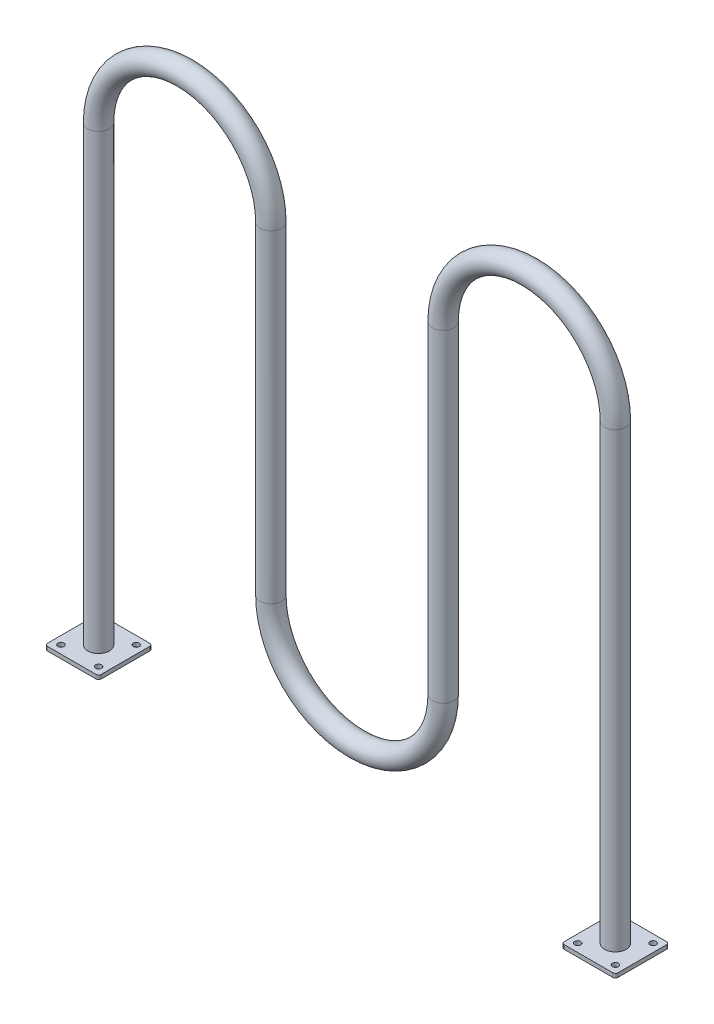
ISO-10303-21;
HEADER;
FILE_DESCRIPTION(('STEP AP214'),'2;1');
FILE_NAME('part.step','',(''),(''),'','','');
FILE_SCHEMA(('AUTOMOTIVE_DESIGN { 1 0 10303 214 1 1 1 1 }'));
ENDSEC;
DATA;
#1=APPLICATION_CONTEXT('core data for automotive mechanical design processes');
#2=APPLICATION_PROTOCOL_DEFINITION('international standard','automotive_design',2000,#1);
#3=PRODUCT_CONTEXT('',#1,'mechanical');
#4=PRODUCT('Part','Part','',(#3));
#5=PRODUCT_RELATED_PRODUCT_CATEGORY('part','',(#4));
#6=PRODUCT_DEFINITION_FORMATION('','',#4);
#7=PRODUCT_DEFINITION_CONTEXT('part definition',#1,'design');
#8=PRODUCT_DEFINITION('design','',#6,#7);
#9=PRODUCT_DEFINITION_SHAPE('','',#8);
#10=(LENGTH_UNIT() NAMED_UNIT(*) SI_UNIT(.MILLI.,.METRE.));
#11=(NAMED_UNIT(*) PLANE_ANGLE_UNIT() SI_UNIT($,.RADIAN.));
#12=(NAMED_UNIT(*) SI_UNIT($,.STERADIAN.) SOLID_ANGLE_UNIT());
#13=UNCERTAINTY_MEASURE_WITH_UNIT(LENGTH_MEASURE(1.E-05),#10,'distance_accuracy_value','');
#14=(GEOMETRIC_REPRESENTATION_CONTEXT(3) GLOBAL_UNCERTAINTY_ASSIGNED_CONTEXT((#13)) GLOBAL_UNIT_ASSIGNED_CONTEXT((#10,
#11,#12)) REPRESENTATION_CONTEXT('',''));
#15=CARTESIAN_POINT('',(0.,0.,0.));
#16=DIRECTION('',(0.,0.,1.));
#17=DIRECTION('',(1.,0.,0.));
#18=AXIS2_PLACEMENT_3D('',#15,#16,#17);
#19=CARTESIAN_POINT('',(609.6,-304.8,0.));
#20=DIRECTION('',(0.,1.,0.));
#21=DIRECTION('',(-1.,0.,0.));
#22=AXIS2_PLACEMENT_3D('',#19,#20,#21);
#23=CYLINDRICAL_SURFACE('',#22,25.4);
#24=CARTESIAN_POINT('',(609.6,762.,0.));
#25=DIRECTION('',(0.,-1.,0.));
#26=DIRECTION('',(1.,0.,0.));
#27=AXIS2_PLACEMENT_3D('',#24,#25,#26);
#28=CIRCLE('',#27,25.4);
#29=CARTESIAN_POINT('',(635.,762.,0.));
#30=VERTEX_POINT('',#29);
#31=EDGE_CURVE('E240',#30,#30,#28,.T.);
#32=ORIENTED_EDGE('',*,*,#31,.T.);
#33=EDGE_LOOP('',(#32));
#34=FACE_BOUND('',#33,.T.);
#35=CARTESIAN_POINT('',(609.6,-304.8,0.));
#36=DIRECTION('',(0.,-1.,0.));
#37=DIRECTION('',(1.,0.,0.));
#38=AXIS2_PLACEMENT_3D('',#35,#36,#37);
#39=CIRCLE('',#38,25.4);
#40=CARTESIAN_POINT('',(635.,-304.8,0.));
#41=VERTEX_POINT('',#40);
#42=EDGE_CURVE('E237',#41,#41,#39,.T.);
#43=ORIENTED_EDGE('',*,*,#42,.F.);
#44=EDGE_LOOP('',(#43));
#45=FACE_BOUND('',#44,.T.);
#46=ADVANCED_FACE('F62',(#34,#45),#23,.T.);
#47=CARTESIAN_POINT('',(406.4,762.,0.));
#48=DIRECTION('',(0.,0.,1.));
#49=DIRECTION('',(1.,0.,0.));
#50=AXIS2_PLACEMENT_3D('',#47,#48,#49);
#51=TOROIDAL_SURFACE('',#50,203.2,25.4);
#52=CARTESIAN_POINT('',(203.2,762.,0.));
#53=DIRECTION('',(0.,1.,0.));
#54=DIRECTION('',(-1.,0.,0.));
#55=AXIS2_PLACEMENT_3D('',#52,#53,#54);
#56=CIRCLE('',#55,25.4);
#57=CARTESIAN_POINT('',(177.8,762.,0.));
#58=VERTEX_POINT('',#57);
#59=EDGE_CURVE('E243',#58,#58,#56,.T.);
#60=CARTESIAN_POINT('',(406.4,762.,0.));
#61=DIRECTION('',(0.,0.,1.));
#62=DIRECTION('',(1.,0.,0.));
#63=AXIS2_PLACEMENT_3D('',#60,#61,#62);
#64=CIRCLE('',#63,228.6);
#65=EDGE_CURVE('',#30,#58,#64,.T.);
#66=ORIENTED_EDGE('',*,*,#31,.F.);
#67=ORIENTED_EDGE('',*,*,#59,.T.);
#68=ORIENTED_EDGE('',*,*,#65,.T.);
#69=ORIENTED_EDGE('',*,*,#65,.F.);
#70=EDGE_LOOP('',(#66,#68,#67,#69));
#71=FACE_BOUND('',#70,.T.);
#72=ADVANCED_FACE('F839',(#71),#51,.T.);
#73=CARTESIAN_POINT('',(203.2,762.,0.));
#74=DIRECTION('',(0.,-1.,0.));
#75=DIRECTION('',(0.,0.,-1.));
#76=AXIS2_PLACEMENT_3D('',#73,#74,#75);
#77=CYLINDRICAL_SURFACE('',#76,25.4);
#78=CARTESIAN_POINT('',(203.2,0.,0.));
#79=DIRECTION('',(0.,1.,0.));
#80=DIRECTION('',(-1.,0.,0.));
#81=AXIS2_PLACEMENT_3D('',#78,#79,#80);
#82=CIRCLE('',#81,25.4);
#83=CARTESIAN_POINT('',(228.6,0.,0.));
#84=VERTEX_POINT('',#83);
#85=EDGE_CURVE('E246',#84,#84,#82,.T.);
#86=ORIENTED_EDGE('',*,*,#85,.T.);
#87=EDGE_LOOP('',(#86));
#88=FACE_BOUND('',#87,.T.);
#89=ORIENTED_EDGE('',*,*,#59,.F.);
#90=EDGE_LOOP('',(#89));
#91=FACE_BOUND('',#90,.T.);
#92=ADVANCED_FACE('F830',(#88,#91),#77,.T.);
#93=CARTESIAN_POINT('',(0.,0.,0.));
#94=DIRECTION('',(0.,0.,-1.));
#95=DIRECTION('',(-1.,0.,0.));
#96=AXIS2_PLACEMENT_3D('',#93,#94,#95);
#97=TOROIDAL_SURFACE('',#96,203.2,25.4);
#98=CARTESIAN_POINT('',(-203.2,0.,0.));
#99=DIRECTION('',(0.,-1.,0.));
#100=DIRECTION('',(1.,0.,0.));
#101=AXIS2_PLACEMENT_3D('',#98,#99,#100);
#102=CIRCLE('',#101,25.4);
#103=CARTESIAN_POINT('',(-228.6,0.,0.));
#104=VERTEX_POINT('',#103);
#105=EDGE_CURVE('E249',#104,#104,#102,.T.);
#106=CARTESIAN_POINT('',(0.,0.,0.));
#107=DIRECTION('',(0.,0.,-1.));
#108=DIRECTION('',(-1.,0.,0.));
#109=AXIS2_PLACEMENT_3D('',#106,#107,#108);
#110=CIRCLE('',#109,228.6);
#111=EDGE_CURVE('',#84,#104,#110,.T.);
#112=ORIENTED_EDGE('',*,*,#85,.F.);
#113=ORIENTED_EDGE('',*,*,#105,.T.);
#114=ORIENTED_EDGE('',*,*,#111,.T.);
#115=ORIENTED_EDGE('',*,*,#111,.F.);
#116=EDGE_LOOP('',(#112,#114,#113,#115));
#117=FACE_BOUND('',#116,.T.);
#118=ADVANCED_FACE('F822',(#117),#97,.T.);
#119=CARTESIAN_POINT('',(-203.2,0.,0.));
#120=DIRECTION('',(0.,1.,0.));
#121=DIRECTION('',(0.,0.,1.));
#122=AXIS2_PLACEMENT_3D('',#119,#120,#121);
#123=CYLINDRICAL_SURFACE('',#122,25.4);
#124=CARTESIAN_POINT('',(-203.2,762.,0.));
#125=DIRECTION('',(0.,-1.,0.));
#126=DIRECTION('',(1.,0.,0.));
#127=AXIS2_PLACEMENT_3D('',#124,#125,#126);
#128=CIRCLE('',#127,25.4);
#129=CARTESIAN_POINT('',(-177.8,762.,0.));
#130=VERTEX_POINT('',#129);
#131=EDGE_CURVE('E252',#130,#130,#128,.T.);
#132=ORIENTED_EDGE('',*,*,#131,.T.);
#133=EDGE_LOOP('',(#132));
#134=FACE_BOUND('',#133,.T.);
#135=ORIENTED_EDGE('',*,*,#105,.F.);
#136=EDGE_LOOP('',(#135));
#137=FACE_BOUND('',#136,.T.);
#138=ADVANCED_FACE('F407',(#134,#137),#123,.T.);
#139=CARTESIAN_POINT('',(-406.4,762.,0.));
#140=DIRECTION('',(0.,0.,1.));
#141=DIRECTION('',(1.,0.,0.));
#142=AXIS2_PLACEMENT_3D('',#139,#140,#141);
#143=TOROIDAL_SURFACE('',#142,203.2,25.4);
#144=CARTESIAN_POINT('',(-609.6,762.,0.));
#145=DIRECTION('',(0.,1.,0.));
#146=DIRECTION('',(-1.,0.,0.));
#147=AXIS2_PLACEMENT_3D('',#144,#145,#146);
#148=CIRCLE('',#147,25.4);
#149=CARTESIAN_POINT('',(-635.,762.,0.));
#150=VERTEX_POINT('',#149);
#151=EDGE_CURVE('E255',#150,#150,#148,.T.);
#152=CARTESIAN_POINT('',(-406.4,762.,0.));
#153=DIRECTION('',(0.,0.,1.));
#154=DIRECTION('',(1.,0.,0.));
#155=AXIS2_PLACEMENT_3D('',#152,#153,#154);
#156=CIRCLE('',#155,228.6);
#157=EDGE_CURVE('',#130,#150,#156,.T.);
#158=ORIENTED_EDGE('',*,*,#131,.F.);
#159=ORIENTED_EDGE('',*,*,#151,.T.);
#160=ORIENTED_EDGE('',*,*,#157,.T.);
#161=ORIENTED_EDGE('',*,*,#157,.F.);
#162=EDGE_LOOP('',(#158,#160,#159,#161));
#163=FACE_BOUND('',#162,.T.);
#164=ADVANCED_FACE('F399',(#163),#143,.T.);
#165=CARTESIAN_POINT('',(-609.6,762.,0.));
#166=DIRECTION('',(0.,-1.,0.));
#167=DIRECTION('',(1.,0.,0.));
#168=AXIS2_PLACEMENT_3D('',#165,#166,#167);
#169=CYLINDRICAL_SURFACE('',#168,25.4);
#170=CARTESIAN_POINT('',(-609.6,-304.8,0.));
#171=DIRECTION('',(0.,1.,0.));
#172=DIRECTION('',(-1.,0.,0.));
#173=AXIS2_PLACEMENT_3D('',#170,#171,#172);
#174=CIRCLE('',#173,25.4);
#175=CARTESIAN_POINT('',(-635.,-304.8,0.));
#176=VERTEX_POINT('',#175);
#177=EDGE_CURVE('E213',#176,#176,#174,.T.);
#178=ORIENTED_EDGE('',*,*,#177,.T.);
#179=EDGE_LOOP('',(#178));
#180=FACE_BOUND('',#179,.T.);
#181=ORIENTED_EDGE('',*,*,#151,.F.);
#182=EDGE_LOOP('',(#181));
#183=FACE_BOUND('',#182,.T.);
#184=ADVANCED_FACE('F397',(#180,#183),#169,.T.);
#185=CARTESIAN_POINT('',(1.36357091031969E-13,-314.325,0.));
#186=DIRECTION('',(0.,1.,0.));
#187=DIRECTION('',(-1.,0.,0.));
#188=AXIS2_PLACEMENT_3D('',#185,#186,#187);
#189=PLANE('',#188);
#190=DIRECTION('',(0.,0.,-1.));
#191=VECTOR('',#190,1.);
#192=CARTESIAN_POINT('',(-673.099999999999,-314.325,-63.5));
#193=LINE('',#192,#191);
#194=CARTESIAN_POINT('',(-673.099999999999,-314.325,57.1500000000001));
#195=VERTEX_POINT('',#194);
#196=CARTESIAN_POINT('',(-673.099999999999,-314.325,-57.15));
#197=VERTEX_POINT('',#196);
#198=EDGE_CURVE('E365',#195,#197,#193,.T.);
#199=ORIENTED_EDGE('',*,*,#198,.T.);
#200=CARTESIAN_POINT('',(-666.75,-314.325,-57.15));
#201=DIRECTION('',(0.,1.,0.));
#202=DIRECTION('',(-1.,0.,0.));
#203=AXIS2_PLACEMENT_3D('',#200,#201,#202);
#204=CIRCLE('',#203,6.35);
#205=CARTESIAN_POINT('',(-666.75,-314.325,-63.5));
#206=VERTEX_POINT('',#205);
#207=EDGE_CURVE('E272',#197,#206,#204,.F.);
#208=ORIENTED_EDGE('',*,*,#207,.T.);
#209=DIRECTION('',(1.,0.,0.));
#210=VECTOR('',#209,1.);
#211=CARTESIAN_POINT('',(-673.099999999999,-314.325,-63.5));
#212=LINE('',#211,#210);
#213=CARTESIAN_POINT('',(-552.449999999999,-314.325,-63.5));
#214=VERTEX_POINT('',#213);
#215=EDGE_CURVE('E196',#206,#214,#212,.T.);
#216=ORIENTED_EDGE('',*,*,#215,.T.);
#217=CARTESIAN_POINT('',(-552.449999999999,-314.325,-57.15));
#218=DIRECTION('',(0.,1.,0.));
#219=DIRECTION('',(-1.,0.,0.));
#220=AXIS2_PLACEMENT_3D('',#217,#218,#219);
#221=CIRCLE('',#220,6.35);
#222=CARTESIAN_POINT('',(-546.099999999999,-314.325,-57.15));
#223=VERTEX_POINT('',#222);
#224=EDGE_CURVE('E270',#214,#223,#221,.F.);
#225=ORIENTED_EDGE('',*,*,#224,.T.);
#226=DIRECTION('',(0.,0.,1.));
#227=VECTOR('',#226,1.);
#228=CARTESIAN_POINT('',(-546.099999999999,-314.325,-63.5));
#229=LINE('',#228,#227);
#230=CARTESIAN_POINT('',(-546.099999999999,-314.325,57.1500000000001));
#231=VERTEX_POINT('',#230);
#232=EDGE_CURVE('E203',#223,#231,#229,.T.);
#233=ORIENTED_EDGE('',*,*,#232,.T.);
#234=CARTESIAN_POINT('',(-552.449999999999,-314.325,57.1500000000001));
#235=DIRECTION('',(0.,1.,0.));
#236=DIRECTION('',(-1.,0.,0.));
#237=AXIS2_PLACEMENT_3D('',#234,#235,#236);
#238=CIRCLE('',#237,6.35);
#239=CARTESIAN_POINT('',(-552.449999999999,-314.325,63.5000000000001));
#240=VERTEX_POINT('',#239);
#241=EDGE_CURVE('E268',#231,#240,#238,.F.);
#242=ORIENTED_EDGE('',*,*,#241,.T.);
#243=DIRECTION('',(-1.,0.,0.));
#244=VECTOR('',#243,1.);
#245=CARTESIAN_POINT('',(-673.099999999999,-314.325,63.5000000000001));
#246=LINE('',#245,#244);
#247=CARTESIAN_POINT('',(-666.75,-314.325,63.5000000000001));
#248=VERTEX_POINT('',#247);
#249=EDGE_CURVE('E207',#240,#248,#246,.T.);
#250=ORIENTED_EDGE('',*,*,#249,.T.);
#251=CARTESIAN_POINT('',(-666.75,-314.325,57.1500000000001));
#252=DIRECTION('',(0.,1.,0.));
#253=DIRECTION('',(-1.,0.,0.));
#254=AXIS2_PLACEMENT_3D('',#251,#252,#253);
#255=CIRCLE('',#254,6.35);
#256=EDGE_CURVE('E266',#248,#195,#255,.F.);
#257=ORIENTED_EDGE('',*,*,#256,.T.);
#258=EDGE_LOOP('',(#199,#208,#216,#225,#233,#242,#250,#257));
#259=FACE_BOUND('',#258,.T.);
#260=CARTESIAN_POINT('',(-654.05,-314.325,44.45));
#261=DIRECTION('',(0.,-1.,0.));
#262=DIRECTION('',(1.,0.,0.));
#263=AXIS2_PLACEMENT_3D('',#260,#261,#262);
#264=CIRCLE('',#263,7.14374999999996);
#265=CARTESIAN_POINT('',(-661.19375,-314.325,44.45));
#266=VERTEX_POINT('',#265);
#267=EDGE_CURVE('E357',#266,#266,#264,.T.);
#268=ORIENTED_EDGE('',*,*,#267,.F.);
#269=EDGE_LOOP('',(#268));
#270=FACE_BOUND('',#269,.T.);
#271=CARTESIAN_POINT('',(-565.15,-314.325,44.45));
#272=DIRECTION('',(0.,-1.,0.));
#273=DIRECTION('',(1.,0.,0.));
#274=AXIS2_PLACEMENT_3D('',#271,#272,#273);
#275=CIRCLE('',#274,7.14374999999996);
#276=CARTESIAN_POINT('',(-572.29375,-314.325,44.45));
#277=VERTEX_POINT('',#276);
#278=EDGE_CURVE('E351',#277,#277,#275,.T.);
#279=ORIENTED_EDGE('',*,*,#278,.F.);
#280=EDGE_LOOP('',(#279));
#281=FACE_BOUND('',#280,.T.);
#282=CARTESIAN_POINT('',(-565.15,-314.325,-44.4499999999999));
#283=DIRECTION('',(0.,-1.,0.));
#284=DIRECTION('',(1.,0.,0.));
#285=AXIS2_PLACEMENT_3D('',#282,#283,#284);
#286=CIRCLE('',#285,7.14374999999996);
#287=CARTESIAN_POINT('',(-572.29375,-314.325,-44.4499999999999));
#288=VERTEX_POINT('',#287);
#289=EDGE_CURVE('E345',#288,#288,#286,.T.);
#290=ORIENTED_EDGE('',*,*,#289,.F.);
#291=EDGE_LOOP('',(#290));
#292=FACE_BOUND('',#291,.T.);
#293=CARTESIAN_POINT('',(-654.05,-314.325,-44.4499999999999));
#294=DIRECTION('',(0.,-1.,0.));
#295=DIRECTION('',(1.,0.,0.));
#296=AXIS2_PLACEMENT_3D('',#293,#294,#295);
#297=CIRCLE('',#296,7.14374999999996);
#298=CARTESIAN_POINT('',(-661.19375,-314.325,-44.4499999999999));
#299=VERTEX_POINT('',#298);
#300=EDGE_CURVE('E339',#299,#299,#297,.T.);
#301=ORIENTED_EDGE('',*,*,#300,.F.);
#302=EDGE_LOOP('',(#301));
#303=FACE_BOUND('',#302,.T.);
#304=ADVANCED_FACE('F383',(#259,#270,#281,#292,#303),#189,.F.);
#305=CARTESIAN_POINT('',(1.33226762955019E-13,-304.8,0.));
#306=DIRECTION('',(0.,1.,0.));
#307=DIRECTION('',(-1.,0.,0.));
#308=AXIS2_PLACEMENT_3D('',#305,#306,#307);
#309=PLANE('',#308);
#310=ORIENTED_EDGE('',*,*,#177,.F.);
#311=EDGE_LOOP('',(#310));
#312=FACE_BOUND('',#311,.T.);
#313=CARTESIAN_POINT('',(-565.15,-304.8,-44.4499999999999));
#314=DIRECTION('',(0.,-1.,0.));
#315=DIRECTION('',(1.,0.,0.));
#316=AXIS2_PLACEMENT_3D('',#313,#314,#315);
#317=CIRCLE('',#316,7.14374999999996);
#318=CARTESIAN_POINT('',(-572.29375,-304.8,-44.4499999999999));
#319=VERTEX_POINT('',#318);
#320=EDGE_CURVE('E342',#319,#319,#317,.T.);
#321=ORIENTED_EDGE('',*,*,#320,.T.);
#322=EDGE_LOOP('',(#321));
#323=FACE_BOUND('',#322,.T.);
#324=CARTESIAN_POINT('',(-654.05,-304.8,44.45));
#325=DIRECTION('',(0.,-1.,0.));
#326=DIRECTION('',(1.,0.,0.));
#327=AXIS2_PLACEMENT_3D('',#324,#325,#326);
#328=CIRCLE('',#327,7.14374999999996);
#329=CARTESIAN_POINT('',(-661.19375,-304.8,44.45));
#330=VERTEX_POINT('',#329);
#331=EDGE_CURVE('E354',#330,#330,#328,.T.);
#332=ORIENTED_EDGE('',*,*,#331,.T.);
#333=EDGE_LOOP('',(#332));
#334=FACE_BOUND('',#333,.T.);
#335=DIRECTION('',(1.,0.,0.));
#336=VECTOR('',#335,1.);
#337=CARTESIAN_POINT('',(-673.099999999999,-304.8,-63.5));
#338=LINE('',#337,#336);
#339=CARTESIAN_POINT('',(-666.75,-304.8,-63.5));
#340=VERTEX_POINT('',#339);
#341=CARTESIAN_POINT('',(-552.449999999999,-304.8,-63.5));
#342=VERTEX_POINT('',#341);
#343=EDGE_CURVE('E193',#340,#342,#338,.T.);
#344=ORIENTED_EDGE('',*,*,#343,.F.);
#345=CARTESIAN_POINT('',(-666.75,-304.8,-57.15));
#346=DIRECTION('',(0.,1.,0.));
#347=DIRECTION('',(-1.,0.,0.));
#348=AXIS2_PLACEMENT_3D('',#345,#346,#347);
#349=CIRCLE('',#348,6.35);
#350=CARTESIAN_POINT('',(-673.099999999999,-304.8,-57.15));
#351=VERTEX_POINT('',#350);
#352=EDGE_CURVE('E176',#340,#351,#349,.T.);
#353=ORIENTED_EDGE('',*,*,#352,.T.);
#354=DIRECTION('',(0.,0.,-1.));
#355=VECTOR('',#354,1.);
#356=CARTESIAN_POINT('',(-673.099999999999,-304.8,-63.5));
#357=LINE('',#356,#355);
#358=CARTESIAN_POINT('',(-673.099999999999,-304.8,57.1500000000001));
#359=VERTEX_POINT('',#358);
#360=EDGE_CURVE('E204',#359,#351,#357,.T.);
#361=ORIENTED_EDGE('',*,*,#360,.F.);
#362=CARTESIAN_POINT('',(-666.75,-304.8,57.1500000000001));
#363=DIRECTION('',(0.,1.,0.));
#364=DIRECTION('',(-1.,0.,0.));
#365=AXIS2_PLACEMENT_3D('',#362,#363,#364);
#366=CIRCLE('',#365,6.35);
#367=CARTESIAN_POINT('',(-666.75,-304.8,63.5000000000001));
#368=VERTEX_POINT('',#367);
#369=EDGE_CURVE('E197',#359,#368,#366,.T.);
#370=ORIENTED_EDGE('',*,*,#369,.T.);
#371=DIRECTION('',(-1.,0.,0.));
#372=VECTOR('',#371,1.);
#373=CARTESIAN_POINT('',(-673.099999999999,-304.8,63.5000000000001));
#374=LINE('',#373,#372);
#375=CARTESIAN_POINT('',(-552.449999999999,-304.8,63.5000000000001));
#376=VERTEX_POINT('',#375);
#377=EDGE_CURVE('E209',#376,#368,#374,.T.);
#378=ORIENTED_EDGE('',*,*,#377,.F.);
#379=CARTESIAN_POINT('',(-552.449999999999,-304.8,57.1500000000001));
#380=DIRECTION('',(0.,1.,0.));
#381=DIRECTION('',(-1.,0.,0.));
#382=AXIS2_PLACEMENT_3D('',#379,#380,#381);
#383=CIRCLE('',#382,6.35);
#384=CARTESIAN_POINT('',(-546.099999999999,-304.8,57.1500000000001));
#385=VERTEX_POINT('',#384);
#386=EDGE_CURVE('E260',#376,#385,#383,.T.);
#387=ORIENTED_EDGE('',*,*,#386,.T.);
#388=DIRECTION('',(0.,0.,1.));
#389=VECTOR('',#388,1.);
#390=CARTESIAN_POINT('',(-546.099999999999,-304.8,-63.5));
#391=LINE('',#390,#389);
#392=CARTESIAN_POINT('',(-546.099999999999,-304.8,-57.15));
#393=VERTEX_POINT('',#392);
#394=EDGE_CURVE('E360',#393,#385,#391,.T.);
#395=ORIENTED_EDGE('',*,*,#394,.F.);
#396=CARTESIAN_POINT('',(-552.449999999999,-304.8,-57.15));
#397=DIRECTION('',(0.,1.,0.));
#398=DIRECTION('',(-1.,0.,0.));
#399=AXIS2_PLACEMENT_3D('',#396,#397,#398);
#400=CIRCLE('',#399,6.35);
#401=EDGE_CURVE('E187',#393,#342,#400,.T.);
#402=ORIENTED_EDGE('',*,*,#401,.T.);
#403=EDGE_LOOP('',(#344,#353,#361,#370,#378,#387,#395,#402));
#404=FACE_BOUND('',#403,.T.);
#405=CARTESIAN_POINT('',(-565.15,-304.8,44.45));
#406=DIRECTION('',(0.,-1.,0.));
#407=DIRECTION('',(1.,0.,0.));
#408=AXIS2_PLACEMENT_3D('',#405,#406,#407);
#409=CIRCLE('',#408,7.14374999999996);
#410=CARTESIAN_POINT('',(-572.29375,-304.8,44.45));
#411=VERTEX_POINT('',#410);
#412=EDGE_CURVE('E348',#411,#411,#409,.T.);
#413=ORIENTED_EDGE('',*,*,#412,.T.);
#414=EDGE_LOOP('',(#413));
#415=FACE_BOUND('',#414,.T.);
#416=CARTESIAN_POINT('',(-654.05,-304.8,-44.4499999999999));
#417=DIRECTION('',(0.,-1.,0.));
#418=DIRECTION('',(1.,0.,0.));
#419=AXIS2_PLACEMENT_3D('',#416,#417,#418);
#420=CIRCLE('',#419,7.14374999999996);
#421=CARTESIAN_POINT('',(-661.19375,-304.8,-44.4499999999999));
#422=VERTEX_POINT('',#421);
#423=EDGE_CURVE('E338',#422,#422,#420,.T.);
#424=ORIENTED_EDGE('',*,*,#423,.T.);
#425=EDGE_LOOP('',(#424));
#426=FACE_BOUND('',#425,.T.);
#427=ADVANCED_FACE('F200',(#312,#323,#334,#404,#415,#426),#309,.T.);
#428=CARTESIAN_POINT('',(-546.099999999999,-314.325,-63.5));
#429=DIRECTION('',(-1.,0.,0.));
#430=DIRECTION('',(0.,-1.,0.));
#431=AXIS2_PLACEMENT_3D('',#428,#429,#430);
#432=PLANE('',#431);
#433=ORIENTED_EDGE('',*,*,#232,.F.);
#434=DIRECTION('',(0.,1.,0.));
#435=VECTOR('',#434,1.);
#436=CARTESIAN_POINT('',(-546.099999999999,-314.325,-57.15));
#437=LINE('',#436,#435);
#438=EDGE_CURVE('E276',#223,#393,#437,.T.);
#439=ORIENTED_EDGE('',*,*,#438,.T.);
#440=ORIENTED_EDGE('',*,*,#394,.T.);
#441=DIRECTION('',(0.,1.,0.));
#442=VECTOR('',#441,1.);
#443=CARTESIAN_POINT('',(-546.099999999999,-314.325,57.1500000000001));
#444=LINE('',#443,#442);
#445=EDGE_CURVE('E274',#385,#231,#444,.F.);
#446=ORIENTED_EDGE('',*,*,#445,.T.);
#447=EDGE_LOOP('',(#433,#439,#440,#446));
#448=FACE_BOUND('',#447,.T.);
#449=ADVANCED_FACE('F395',(#448),#432,.F.);
#450=CARTESIAN_POINT('',(-673.099999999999,-314.325,63.5000000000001));
#451=DIRECTION('',(0.,0.,-1.));
#452=DIRECTION('',(-1.,0.,0.));
#453=AXIS2_PLACEMENT_3D('',#450,#451,#452);
#454=PLANE('',#453);
#455=ORIENTED_EDGE('',*,*,#249,.F.);
#456=DIRECTION('',(0.,1.,0.));
#457=VECTOR('',#456,1.);
#458=CARTESIAN_POINT('',(-552.449999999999,-314.325,63.5000000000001));
#459=LINE('',#458,#457);
#460=EDGE_CURVE('E281',#240,#376,#459,.T.);
#461=ORIENTED_EDGE('',*,*,#460,.T.);
#462=ORIENTED_EDGE('',*,*,#377,.T.);
#463=DIRECTION('',(0.,1.,0.));
#464=VECTOR('',#463,1.);
#465=CARTESIAN_POINT('',(-666.75,-314.325,63.5000000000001));
#466=LINE('',#465,#464);
#467=EDGE_CURVE('E279',#368,#248,#466,.F.);
#468=ORIENTED_EDGE('',*,*,#467,.T.);
#469=EDGE_LOOP('',(#455,#461,#462,#468));
#470=FACE_BOUND('',#469,.T.);
#471=ADVANCED_FACE('F375',(#470),#454,.F.);
#472=CARTESIAN_POINT('',(-673.099999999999,-314.325,-63.5));
#473=DIRECTION('',(1.,0.,0.));
#474=DIRECTION('',(0.,1.,0.));
#475=AXIS2_PLACEMENT_3D('',#472,#473,#474);
#476=PLANE('',#475);
#477=ORIENTED_EDGE('',*,*,#360,.T.);
#478=DIRECTION('',(0.,1.,0.));
#479=VECTOR('',#478,1.);
#480=CARTESIAN_POINT('',(-673.099999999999,-314.325,-57.15));
#481=LINE('',#480,#479);
#482=EDGE_CURVE('E181',#351,#197,#481,.F.);
#483=ORIENTED_EDGE('',*,*,#482,.T.);
#484=ORIENTED_EDGE('',*,*,#198,.F.);
#485=DIRECTION('',(0.,1.,0.));
#486=VECTOR('',#485,1.);
#487=CARTESIAN_POINT('',(-673.099999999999,-314.325,57.1500000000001));
#488=LINE('',#487,#486);
#489=EDGE_CURVE('E186',#195,#359,#488,.T.);
#490=ORIENTED_EDGE('',*,*,#489,.T.);
#491=EDGE_LOOP('',(#477,#483,#484,#490));
#492=FACE_BOUND('',#491,.T.);
#493=ADVANCED_FACE('F386',(#492),#476,.F.);
#494=CARTESIAN_POINT('',(-673.099999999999,-314.325,-63.5));
#495=DIRECTION('',(0.,0.,1.));
#496=DIRECTION('',(1.,0.,0.));
#497=AXIS2_PLACEMENT_3D('',#494,#495,#496);
#498=PLANE('',#497);
#499=ORIENTED_EDGE('',*,*,#215,.F.);
#500=DIRECTION('',(0.,1.,0.));
#501=VECTOR('',#500,1.);
#502=CARTESIAN_POINT('',(-666.75,-314.325,-63.5));
#503=LINE('',#502,#501);
#504=EDGE_CURVE('E180',#206,#340,#503,.T.);
#505=ORIENTED_EDGE('',*,*,#504,.T.);
#506=ORIENTED_EDGE('',*,*,#343,.T.);
#507=DIRECTION('',(0.,1.,0.));
#508=VECTOR('',#507,1.);
#509=CARTESIAN_POINT('',(-552.449999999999,-314.325,-63.5));
#510=LINE('',#509,#508);
#511=EDGE_CURVE('E198',#342,#214,#510,.F.);
#512=ORIENTED_EDGE('',*,*,#511,.T.);
#513=EDGE_LOOP('',(#499,#505,#506,#512));
#514=FACE_BOUND('',#513,.T.);
#515=ADVANCED_FACE('F192',(#514),#498,.F.);
#516=CARTESIAN_POINT('',(-654.05,-314.325,44.45));
#517=DIRECTION('',(0.,1.,0.));
#518=DIRECTION('',(-1.,0.,0.));
#519=AXIS2_PLACEMENT_3D('',#516,#517,#518);
#520=CYLINDRICAL_SURFACE('',#519,7.14374999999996);
#521=CARTESIAN_POINT('',(-661.19375,-314.325,44.45));
#522=CARTESIAN_POINT('',(-661.19375,-314.22578125,44.45));
#523=CARTESIAN_POINT('',(-661.19375,-314.1265625,44.45));
#524=CARTESIAN_POINT('',(-661.19375,-313.928125,44.45));
#525=CARTESIAN_POINT('',(-661.19375,-313.82890625,44.45));
#526=CARTESIAN_POINT('',(-661.19375,-313.63046875,44.45));
#527=CARTESIAN_POINT('',(-661.19375,-313.53125,44.45));
#528=CARTESIAN_POINT('',(-661.19375,-313.3328125,44.45));
#529=CARTESIAN_POINT('',(-661.19375,-313.23359375,44.45));
#530=CARTESIAN_POINT('',(-661.19375,-313.03515625,44.45));
#531=CARTESIAN_POINT('',(-661.19375,-312.9359375,44.45));
#532=CARTESIAN_POINT('',(-661.19375,-312.7375,44.45));
#533=CARTESIAN_POINT('',(-661.19375,-312.63828125,44.45));
#534=CARTESIAN_POINT('',(-661.19375,-312.43984375,44.45));
#535=CARTESIAN_POINT('',(-661.19375,-312.340625,44.45));
#536=CARTESIAN_POINT('',(-661.19375,-312.1421875,44.45));
#537=CARTESIAN_POINT('',(-661.19375,-312.04296875,44.45));
#538=CARTESIAN_POINT('',(-661.19375,-311.84453125,44.45));
#539=CARTESIAN_POINT('',(-661.19375,-311.7453125,44.45));
#540=CARTESIAN_POINT('',(-661.19375,-311.546875,44.45));
#541=CARTESIAN_POINT('',(-661.19375,-311.44765625,44.45));
#542=CARTESIAN_POINT('',(-661.19375,-311.24921875,44.45));
#543=CARTESIAN_POINT('',(-661.19375,-311.15,44.45));
#544=CARTESIAN_POINT('',(-661.19375,-310.9515625,44.45));
#545=CARTESIAN_POINT('',(-661.19375,-310.85234375,44.45));
#546=CARTESIAN_POINT('',(-661.19375,-310.65390625,44.45));
#547=CARTESIAN_POINT('',(-661.19375,-310.5546875,44.45));
#548=CARTESIAN_POINT('',(-661.19375,-310.35625,44.45));
#549=CARTESIAN_POINT('',(-661.19375,-310.25703125,44.45));
#550=CARTESIAN_POINT('',(-661.19375,-310.05859375,44.45));
#551=CARTESIAN_POINT('',(-661.19375,-309.959375,44.45));
#552=CARTESIAN_POINT('',(-661.19375,-309.7609375,44.45));
#553=CARTESIAN_POINT('',(-661.19375,-309.66171875,44.45));
#554=CARTESIAN_POINT('',(-661.19375,-309.46328125,44.45));
#555=CARTESIAN_POINT('',(-661.19375,-309.3640625,44.45));
#556=CARTESIAN_POINT('',(-661.19375,-309.165625,44.45));
#557=CARTESIAN_POINT('',(-661.19375,-309.06640625,44.45));
#558=CARTESIAN_POINT('',(-661.19375,-308.86796875,44.45));
#559=CARTESIAN_POINT('',(-661.19375,-308.76875,44.45));
#560=CARTESIAN_POINT('',(-661.19375,-308.5703125,44.45));
#561=CARTESIAN_POINT('',(-661.19375,-308.47109375,44.45));
#562=CARTESIAN_POINT('',(-661.19375,-308.27265625,44.45));
#563=CARTESIAN_POINT('',(-661.19375,-308.1734375,44.45));
#564=CARTESIAN_POINT('',(-661.19375,-307.975,44.45));
#565=CARTESIAN_POINT('',(-661.19375,-307.87578125,44.45));
#566=CARTESIAN_POINT('',(-661.19375,-307.67734375,44.45));
#567=CARTESIAN_POINT('',(-661.19375,-307.578125,44.45));
#568=CARTESIAN_POINT('',(-661.19375,-307.3796875,44.45));
#569=CARTESIAN_POINT('',(-661.19375,-307.28046875,44.45));
#570=CARTESIAN_POINT('',(-661.19375,-307.08203125,44.45));
#571=CARTESIAN_POINT('',(-661.19375,-306.9828125,44.45));
#572=CARTESIAN_POINT('',(-661.19375,-306.784375,44.45));
#573=CARTESIAN_POINT('',(-661.19375,-306.68515625,44.45));
#574=CARTESIAN_POINT('',(-661.19375,-306.48671875,44.45));
#575=CARTESIAN_POINT('',(-661.19375,-306.3875,44.45));
#576=CARTESIAN_POINT('',(-661.19375,-306.1890625,44.45));
#577=CARTESIAN_POINT('',(-661.19375,-306.08984375,44.45));
#578=CARTESIAN_POINT('',(-661.19375,-305.89140625,44.45));
#579=CARTESIAN_POINT('',(-661.19375,-305.7921875,44.45));
#580=CARTESIAN_POINT('',(-661.19375,-305.59375,44.45));
#581=CARTESIAN_POINT('',(-661.19375,-305.49453125,44.45));
#582=CARTESIAN_POINT('',(-661.19375,-305.29609375,44.45));
#583=CARTESIAN_POINT('',(-661.19375,-305.196875,44.45));
#584=CARTESIAN_POINT('',(-661.19375,-304.9984375,44.45));
#585=CARTESIAN_POINT('',(-661.19375,-304.89921875,44.45));
#586=CARTESIAN_POINT('',(-661.19375,-304.8,44.45));
#587=B_SPLINE_CURVE_WITH_KNOTS('',3,(#521,#522,#523,#524,#525,#526,#527,#528,#529,#530,#531,
#532,#533,#534,#535,#536,#537,#538,#539,#540,#541,#542,#543,#544,#545,#546,#547,#548,#549,#550,
#551,#552,#553,#554,#555,#556,#557,#558,#559,#560,#561,#562,#563,#564,#565,#566,#567,#568,#569,
#570,#571,#572,#573,#574,#575,#576,#577,#578,#579,#580,#581,#582,#583,#584,#585,#586),
.UNSPECIFIED.,.F.,.F.,(4,2,2,2,2,2,2,2,2,2,2,2,2,2,2,2,2,2,2,2,2,2,2,2,2,2,2,2,2,2,2,2,4),(0.,
0.297656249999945,0.595312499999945,0.892968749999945,1.19062499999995,1.48828124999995,
1.78593749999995,2.08359374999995,2.38124999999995,2.67890624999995,2.97656249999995,
3.27421874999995,3.57187499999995,3.86953124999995,4.16718749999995,4.46484374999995,
4.76249999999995,5.06015624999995,5.35781249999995,5.65546874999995,5.95312499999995,
6.25078124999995,6.54843749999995,6.84609374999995,7.14374999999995,7.44140624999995,
7.73906249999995,8.03671874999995,8.33437499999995,8.63203124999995,8.92968749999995,
9.22734374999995,9.52499999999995),.UNSPECIFIED.);
#588=EDGE_CURVE('BSEAM393',#266,#330,#587,.T.);
#589=ORIENTED_EDGE('',*,*,#267,.T.);
#590=ORIENTED_EDGE('',*,*,#331,.F.);
#591=ORIENTED_EDGE('',*,*,#588,.T.);
#592=ORIENTED_EDGE('',*,*,#588,.F.);
#593=EDGE_LOOP('',(#589,#591,#590,#592));
#594=FACE_BOUND('',#593,.T.);
#595=ADVANCED_FACE('F393',(#594),#520,.F.);
#596=CARTESIAN_POINT('',(-565.15,-314.325,44.45));
#597=DIRECTION('',(0.,1.,0.));
#598=DIRECTION('',(-1.,0.,0.));
#599=AXIS2_PLACEMENT_3D('',#596,#597,#598);
#600=CYLINDRICAL_SURFACE('',#599,7.14374999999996);
#601=CARTESIAN_POINT('',(-572.29375,-314.325,44.45));
#602=CARTESIAN_POINT('',(-572.29375,-314.22578125,44.45));
#603=CARTESIAN_POINT('',(-572.29375,-314.1265625,44.45));
#604=CARTESIAN_POINT('',(-572.29375,-313.928125,44.45));
#605=CARTESIAN_POINT('',(-572.29375,-313.82890625,44.45));
#606=CARTESIAN_POINT('',(-572.29375,-313.63046875,44.45));
#607=CARTESIAN_POINT('',(-572.29375,-313.53125,44.45));
#608=CARTESIAN_POINT('',(-572.29375,-313.3328125,44.45));
#609=CARTESIAN_POINT('',(-572.29375,-313.23359375,44.45));
#610=CARTESIAN_POINT('',(-572.29375,-313.03515625,44.45));
#611=CARTESIAN_POINT('',(-572.29375,-312.9359375,44.45));
#612=CARTESIAN_POINT('',(-572.29375,-312.7375,44.45));
#613=CARTESIAN_POINT('',(-572.29375,-312.63828125,44.45));
#614=CARTESIAN_POINT('',(-572.29375,-312.43984375,44.45));
#615=CARTESIAN_POINT('',(-572.29375,-312.340625,44.45));
#616=CARTESIAN_POINT('',(-572.29375,-312.1421875,44.45));
#617=CARTESIAN_POINT('',(-572.29375,-312.04296875,44.45));
#618=CARTESIAN_POINT('',(-572.29375,-311.84453125,44.45));
#619=CARTESIAN_POINT('',(-572.29375,-311.7453125,44.45));
#620=CARTESIAN_POINT('',(-572.29375,-311.546875,44.45));
#621=CARTESIAN_POINT('',(-572.29375,-311.44765625,44.45));
#622=CARTESIAN_POINT('',(-572.29375,-311.24921875,44.45));
#623=CARTESIAN_POINT('',(-572.29375,-311.15,44.45));
#624=CARTESIAN_POINT('',(-572.29375,-310.9515625,44.45));
#625=CARTESIAN_POINT('',(-572.29375,-310.85234375,44.45));
#626=CARTESIAN_POINT('',(-572.29375,-310.65390625,44.45));
#627=CARTESIAN_POINT('',(-572.29375,-310.5546875,44.45));
#628=CARTESIAN_POINT('',(-572.29375,-310.35625,44.45));
#629=CARTESIAN_POINT('',(-572.29375,-310.25703125,44.45));
#630=CARTESIAN_POINT('',(-572.29375,-310.05859375,44.45));
#631=CARTESIAN_POINT('',(-572.29375,-309.959375,44.45));
#632=CARTESIAN_POINT('',(-572.29375,-309.7609375,44.45));
#633=CARTESIAN_POINT('',(-572.29375,-309.66171875,44.45));
#634=CARTESIAN_POINT('',(-572.29375,-309.46328125,44.45));
#635=CARTESIAN_POINT('',(-572.29375,-309.3640625,44.45));
#636=CARTESIAN_POINT('',(-572.29375,-309.165625,44.45));
#637=CARTESIAN_POINT('',(-572.29375,-309.06640625,44.45));
#638=CARTESIAN_POINT('',(-572.29375,-308.86796875,44.45));
#639=CARTESIAN_POINT('',(-572.29375,-308.76875,44.45));
#640=CARTESIAN_POINT('',(-572.29375,-308.5703125,44.45));
#641=CARTESIAN_POINT('',(-572.29375,-308.47109375,44.45));
#642=CARTESIAN_POINT('',(-572.29375,-308.27265625,44.45));
#643=CARTESIAN_POINT('',(-572.29375,-308.1734375,44.45));
#644=CARTESIAN_POINT('',(-572.29375,-307.975,44.45));
#645=CARTESIAN_POINT('',(-572.29375,-307.87578125,44.45));
#646=CARTESIAN_POINT('',(-572.29375,-307.67734375,44.45));
#647=CARTESIAN_POINT('',(-572.29375,-307.578125,44.45));
#648=CARTESIAN_POINT('',(-572.29375,-307.3796875,44.45));
#649=CARTESIAN_POINT('',(-572.29375,-307.28046875,44.45));
#650=CARTESIAN_POINT('',(-572.29375,-307.08203125,44.45));
#651=CARTESIAN_POINT('',(-572.29375,-306.9828125,44.45));
#652=CARTESIAN_POINT('',(-572.29375,-306.784375,44.45));
#653=CARTESIAN_POINT('',(-572.29375,-306.68515625,44.45));
#654=CARTESIAN_POINT('',(-572.29375,-306.48671875,44.45));
#655=CARTESIAN_POINT('',(-572.29375,-306.3875,44.45));
#656=CARTESIAN_POINT('',(-572.29375,-306.1890625,44.45));
#657=CARTESIAN_POINT('',(-572.29375,-306.08984375,44.45));
#658=CARTESIAN_POINT('',(-572.29375,-305.89140625,44.45));
#659=CARTESIAN_POINT('',(-572.29375,-305.7921875,44.45));
#660=CARTESIAN_POINT('',(-572.29375,-305.59375,44.45));
#661=CARTESIAN_POINT('',(-572.29375,-305.49453125,44.45));
#662=CARTESIAN_POINT('',(-572.29375,-305.29609375,44.45));
#663=CARTESIAN_POINT('',(-572.29375,-305.196875,44.45));
#664=CARTESIAN_POINT('',(-572.29375,-304.9984375,44.45));
#665=CARTESIAN_POINT('',(-572.29375,-304.89921875,44.45));
#666=CARTESIAN_POINT('',(-572.29375,-304.8,44.45));
#667=B_SPLINE_CURVE_WITH_KNOTS('',3,(#601,#602,#603,#604,#605,#606,#607,#608,#609,#610,#611,
#612,#613,#614,#615,#616,#617,#618,#619,#620,#621,#622,#623,#624,#625,#626,#627,#628,#629,#630,
#631,#632,#633,#634,#635,#636,#637,#638,#639,#640,#641,#642,#643,#644,#645,#646,#647,#648,#649,
#650,#651,#652,#653,#654,#655,#656,#657,#658,#659,#660,#661,#662,#663,#664,#665,#666),
.UNSPECIFIED.,.F.,.F.,(4,2,2,2,2,2,2,2,2,2,2,2,2,2,2,2,2,2,2,2,2,2,2,2,2,2,2,2,2,2,2,2,4),(0.,
0.29765625,0.5953125,0.892968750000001,1.190625,1.48828125,1.7859375,2.08359375,2.38125,
2.67890625,2.9765625,3.27421875,3.571875,3.86953125,4.1671875,4.46484375,4.7625,5.06015625,
5.3578125,5.65546875,5.953125,6.25078125,6.5484375,6.84609375,7.14375,7.44140625,7.7390625,
8.03671875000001,8.334375,8.63203125,8.92968750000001,9.22734375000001,9.52500000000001),.UNSPECIFIED.);
#668=EDGE_CURVE('BSEAM489',#277,#411,#667,.T.);
#669=ORIENTED_EDGE('',*,*,#278,.T.);
#670=ORIENTED_EDGE('',*,*,#412,.F.);
#671=ORIENTED_EDGE('',*,*,#668,.T.);
#672=ORIENTED_EDGE('',*,*,#668,.F.);
#673=EDGE_LOOP('',(#669,#671,#670,#672));
#674=FACE_BOUND('',#673,.T.);
#675=ADVANCED_FACE('F489',(#674),#600,.F.);
#676=CARTESIAN_POINT('',(-565.15,-314.325,-44.4499999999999));
#677=DIRECTION('',(0.,1.,0.));
#678=DIRECTION('',(-1.,0.,0.));
#679=AXIS2_PLACEMENT_3D('',#676,#677,#678);
#680=CYLINDRICAL_SURFACE('',#679,7.14374999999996);
#681=CARTESIAN_POINT('',(-572.29375,-314.325,-44.4499999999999));
#682=CARTESIAN_POINT('',(-572.29375,-314.22578125,-44.4499999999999));
#683=CARTESIAN_POINT('',(-572.29375,-314.1265625,-44.4499999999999));
#684=CARTESIAN_POINT('',(-572.29375,-313.928125,-44.4499999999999));
#685=CARTESIAN_POINT('',(-572.29375,-313.82890625,-44.4499999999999));
#686=CARTESIAN_POINT('',(-572.29375,-313.63046875,-44.4499999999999));
#687=CARTESIAN_POINT('',(-572.29375,-313.53125,-44.4499999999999));
#688=CARTESIAN_POINT('',(-572.29375,-313.3328125,-44.4499999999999));
#689=CARTESIAN_POINT('',(-572.29375,-313.23359375,-44.4499999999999));
#690=CARTESIAN_POINT('',(-572.29375,-313.03515625,-44.4499999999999));
#691=CARTESIAN_POINT('',(-572.29375,-312.9359375,-44.4499999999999));
#692=CARTESIAN_POINT('',(-572.29375,-312.7375,-44.4499999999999));
#693=CARTESIAN_POINT('',(-572.29375,-312.63828125,-44.4499999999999));
#694=CARTESIAN_POINT('',(-572.29375,-312.43984375,-44.4499999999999));
#695=CARTESIAN_POINT('',(-572.29375,-312.340625,-44.4499999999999));
#696=CARTESIAN_POINT('',(-572.29375,-312.1421875,-44.4499999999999));
#697=CARTESIAN_POINT('',(-572.29375,-312.04296875,-44.4499999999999));
#698=CARTESIAN_POINT('',(-572.29375,-311.84453125,-44.4499999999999));
#699=CARTESIAN_POINT('',(-572.29375,-311.7453125,-44.4499999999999));
#700=CARTESIAN_POINT('',(-572.29375,-311.546875,-44.4499999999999));
#701=CARTESIAN_POINT('',(-572.29375,-311.44765625,-44.4499999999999));
#702=CARTESIAN_POINT('',(-572.29375,-311.24921875,-44.4499999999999));
#703=CARTESIAN_POINT('',(-572.29375,-311.15,-44.4499999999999));
#704=CARTESIAN_POINT('',(-572.29375,-310.9515625,-44.4499999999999));
#705=CARTESIAN_POINT('',(-572.29375,-310.85234375,-44.4499999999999));
#706=CARTESIAN_POINT('',(-572.29375,-310.65390625,-44.4499999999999));
#707=CARTESIAN_POINT('',(-572.29375,-310.5546875,-44.4499999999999));
#708=CARTESIAN_POINT('',(-572.29375,-310.35625,-44.4499999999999));
#709=CARTESIAN_POINT('',(-572.29375,-310.25703125,-44.4499999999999));
#710=CARTESIAN_POINT('',(-572.29375,-310.05859375,-44.4499999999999));
#711=CARTESIAN_POINT('',(-572.29375,-309.959375,-44.4499999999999));
#712=CARTESIAN_POINT('',(-572.29375,-309.7609375,-44.4499999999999));
#713=CARTESIAN_POINT('',(-572.29375,-309.66171875,-44.4499999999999));
#714=CARTESIAN_POINT('',(-572.29375,-309.46328125,-44.4499999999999));
#715=CARTESIAN_POINT('',(-572.29375,-309.3640625,-44.4499999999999));
#716=CARTESIAN_POINT('',(-572.29375,-309.165625,-44.4499999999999));
#717=CARTESIAN_POINT('',(-572.29375,-309.06640625,-44.4499999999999));
#718=CARTESIAN_POINT('',(-572.29375,-308.86796875,-44.4499999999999));
#719=CARTESIAN_POINT('',(-572.29375,-308.76875,-44.4499999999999));
#720=CARTESIAN_POINT('',(-572.29375,-308.5703125,-44.4499999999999));
#721=CARTESIAN_POINT('',(-572.29375,-308.47109375,-44.4499999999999));
#722=CARTESIAN_POINT('',(-572.29375,-308.27265625,-44.4499999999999));
#723=CARTESIAN_POINT('',(-572.29375,-308.1734375,-44.4499999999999));
#724=CARTESIAN_POINT('',(-572.29375,-307.975,-44.4499999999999));
#725=CARTESIAN_POINT('',(-572.29375,-307.87578125,-44.4499999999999));
#726=CARTESIAN_POINT('',(-572.29375,-307.67734375,-44.4499999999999));
#727=CARTESIAN_POINT('',(-572.29375,-307.578125,-44.4499999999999));
#728=CARTESIAN_POINT('',(-572.29375,-307.3796875,-44.4499999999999));
#729=CARTESIAN_POINT('',(-572.29375,-307.28046875,-44.4499999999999));
#730=CARTESIAN_POINT('',(-572.29375,-307.08203125,-44.4499999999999));
#731=CARTESIAN_POINT('',(-572.29375,-306.9828125,-44.4499999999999));
#732=CARTESIAN_POINT('',(-572.29375,-306.784375,-44.4499999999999));
#733=CARTESIAN_POINT('',(-572.29375,-306.68515625,-44.4499999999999));
#734=CARTESIAN_POINT('',(-572.29375,-306.48671875,-44.4499999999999));
#735=CARTESIAN_POINT('',(-572.29375,-306.3875,-44.4499999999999));
#736=CARTESIAN_POINT('',(-572.29375,-306.1890625,-44.4499999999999));
#737=CARTESIAN_POINT('',(-572.29375,-306.08984375,-44.4499999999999));
#738=CARTESIAN_POINT('',(-572.29375,-305.89140625,-44.4499999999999));
#739=CARTESIAN_POINT('',(-572.29375,-305.7921875,-44.4499999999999));
#740=CARTESIAN_POINT('',(-572.29375,-305.59375,-44.4499999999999));
#741=CARTESIAN_POINT('',(-572.29375,-305.49453125,-44.4499999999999));
#742=CARTESIAN_POINT('',(-572.29375,-305.29609375,-44.4499999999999));
#743=CARTESIAN_POINT('',(-572.29375,-305.196875,-44.4499999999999));
#744=CARTESIAN_POINT('',(-572.29375,-304.9984375,-44.4499999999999));
#745=CARTESIAN_POINT('',(-572.29375,-304.89921875,-44.4499999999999));
#746=CARTESIAN_POINT('',(-572.29375,-304.8,-44.4499999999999));
#747=B_SPLINE_CURVE_WITH_KNOTS('',3,(#681,#682,#683,#684,#685,#686,#687,#688,#689,#690,#691,
#692,#693,#694,#695,#696,#697,#698,#699,#700,#701,#702,#703,#704,#705,#706,#707,#708,#709,#710,
#711,#712,#713,#714,#715,#716,#717,#718,#719,#720,#721,#722,#723,#724,#725,#726,#727,#728,#729,
#730,#731,#732,#733,#734,#735,#736,#737,#738,#739,#740,#741,#742,#743,#744,#745,#746),
.UNSPECIFIED.,.F.,.F.,(4,2,2,2,2,2,2,2,2,2,2,2,2,2,2,2,2,2,2,2,2,2,2,2,2,2,2,2,2,2,2,2,4),(0.,
0.29765625,0.5953125,0.892968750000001,1.190625,1.48828125,1.7859375,2.08359375,2.38125,
2.67890625,2.9765625,3.27421875,3.571875,3.86953125,4.1671875,4.46484375,4.7625,5.06015625,
5.3578125,5.65546875,5.953125,6.25078125,6.5484375,6.84609375,7.14375,7.44140625,7.7390625,
8.03671875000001,8.334375,8.63203125,8.92968750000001,9.22734375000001,9.52500000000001),.UNSPECIFIED.);
#748=EDGE_CURVE('BSEAM485',#288,#319,#747,.T.);
#749=ORIENTED_EDGE('',*,*,#289,.T.);
#750=ORIENTED_EDGE('',*,*,#320,.F.);
#751=ORIENTED_EDGE('',*,*,#748,.T.);
#752=ORIENTED_EDGE('',*,*,#748,.F.);
#753=EDGE_LOOP('',(#749,#751,#750,#752));
#754=FACE_BOUND('',#753,.T.);
#755=ADVANCED_FACE('F485',(#754),#680,.F.);
#756=CARTESIAN_POINT('',(-654.05,-314.325,-44.4499999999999));
#757=DIRECTION('',(0.,1.,0.));
#758=DIRECTION('',(-1.,0.,0.));
#759=AXIS2_PLACEMENT_3D('',#756,#757,#758);
#760=CYLINDRICAL_SURFACE('',#759,7.14374999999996);
#761=CARTESIAN_POINT('',(-661.19375,-314.325,-44.4499999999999));
#762=CARTESIAN_POINT('',(-661.19375,-314.22578125,-44.4499999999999));
#763=CARTESIAN_POINT('',(-661.19375,-314.1265625,-44.4499999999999));
#764=CARTESIAN_POINT('',(-661.19375,-313.928125,-44.4499999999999));
#765=CARTESIAN_POINT('',(-661.19375,-313.82890625,-44.4499999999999));
#766=CARTESIAN_POINT('',(-661.19375,-313.63046875,-44.4499999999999));
#767=CARTESIAN_POINT('',(-661.19375,-313.53125,-44.4499999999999));
#768=CARTESIAN_POINT('',(-661.19375,-313.3328125,-44.4499999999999));
#769=CARTESIAN_POINT('',(-661.19375,-313.23359375,-44.4499999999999));
#770=CARTESIAN_POINT('',(-661.19375,-313.03515625,-44.4499999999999));
#771=CARTESIAN_POINT('',(-661.19375,-312.9359375,-44.4499999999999));
#772=CARTESIAN_POINT('',(-661.19375,-312.7375,-44.4499999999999));
#773=CARTESIAN_POINT('',(-661.19375,-312.63828125,-44.4499999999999));
#774=CARTESIAN_POINT('',(-661.19375,-312.43984375,-44.4499999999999));
#775=CARTESIAN_POINT('',(-661.19375,-312.340625,-44.4499999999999));
#776=CARTESIAN_POINT('',(-661.19375,-312.1421875,-44.4499999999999));
#777=CARTESIAN_POINT('',(-661.19375,-312.04296875,-44.4499999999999));
#778=CARTESIAN_POINT('',(-661.19375,-311.84453125,-44.4499999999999));
#779=CARTESIAN_POINT('',(-661.19375,-311.7453125,-44.4499999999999));
#780=CARTESIAN_POINT('',(-661.19375,-311.546875,-44.4499999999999));
#781=CARTESIAN_POINT('',(-661.19375,-311.44765625,-44.4499999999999));
#782=CARTESIAN_POINT('',(-661.19375,-311.24921875,-44.4499999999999));
#783=CARTESIAN_POINT('',(-661.19375,-311.15,-44.4499999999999));
#784=CARTESIAN_POINT('',(-661.19375,-310.9515625,-44.4499999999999));
#785=CARTESIAN_POINT('',(-661.19375,-310.85234375,-44.4499999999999));
#786=CARTESIAN_POINT('',(-661.19375,-310.65390625,-44.4499999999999));
#787=CARTESIAN_POINT('',(-661.19375,-310.5546875,-44.4499999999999));
#788=CARTESIAN_POINT('',(-661.19375,-310.35625,-44.4499999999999));
#789=CARTESIAN_POINT('',(-661.19375,-310.25703125,-44.4499999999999));
#790=CARTESIAN_POINT('',(-661.19375,-310.05859375,-44.4499999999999));
#791=CARTESIAN_POINT('',(-661.19375,-309.959375,-44.4499999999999));
#792=CARTESIAN_POINT('',(-661.19375,-309.7609375,-44.4499999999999));
#793=CARTESIAN_POINT('',(-661.19375,-309.66171875,-44.4499999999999));
#794=CARTESIAN_POINT('',(-661.19375,-309.46328125,-44.4499999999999));
#795=CARTESIAN_POINT('',(-661.19375,-309.3640625,-44.4499999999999));
#796=CARTESIAN_POINT('',(-661.19375,-309.165625,-44.4499999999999));
#797=CARTESIAN_POINT('',(-661.19375,-309.06640625,-44.4499999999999));
#798=CARTESIAN_POINT('',(-661.19375,-308.86796875,-44.4499999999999));
#799=CARTESIAN_POINT('',(-661.19375,-308.76875,-44.4499999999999));
#800=CARTESIAN_POINT('',(-661.19375,-308.5703125,-44.4499999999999));
#801=CARTESIAN_POINT('',(-661.19375,-308.47109375,-44.4499999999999));
#802=CARTESIAN_POINT('',(-661.19375,-308.27265625,-44.4499999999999));
#803=CARTESIAN_POINT('',(-661.19375,-308.1734375,-44.4499999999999));
#804=CARTESIAN_POINT('',(-661.19375,-307.975,-44.4499999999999));
#805=CARTESIAN_POINT('',(-661.19375,-307.87578125,-44.4499999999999));
#806=CARTESIAN_POINT('',(-661.19375,-307.67734375,-44.4499999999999));
#807=CARTESIAN_POINT('',(-661.19375,-307.578125,-44.4499999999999));
#808=CARTESIAN_POINT('',(-661.19375,-307.3796875,-44.4499999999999));
#809=CARTESIAN_POINT('',(-661.19375,-307.28046875,-44.4499999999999));
#810=CARTESIAN_POINT('',(-661.19375,-307.08203125,-44.4499999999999));
#811=CARTESIAN_POINT('',(-661.19375,-306.9828125,-44.4499999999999));
#812=CARTESIAN_POINT('',(-661.19375,-306.784375,-44.4499999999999));
#813=CARTESIAN_POINT('',(-661.19375,-306.68515625,-44.4499999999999));
#814=CARTESIAN_POINT('',(-661.19375,-306.48671875,-44.4499999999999));
#815=CARTESIAN_POINT('',(-661.19375,-306.3875,-44.4499999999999));
#816=CARTESIAN_POINT('',(-661.19375,-306.1890625,-44.4499999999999));
#817=CARTESIAN_POINT('',(-661.19375,-306.08984375,-44.4499999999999));
#818=CARTESIAN_POINT('',(-661.19375,-305.89140625,-44.4499999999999));
#819=CARTESIAN_POINT('',(-661.19375,-305.7921875,-44.4499999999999));
#820=CARTESIAN_POINT('',(-661.19375,-305.59375,-44.4499999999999));
#821=CARTESIAN_POINT('',(-661.19375,-305.49453125,-44.4499999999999));
#822=CARTESIAN_POINT('',(-661.19375,-305.29609375,-44.4499999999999));
#823=CARTESIAN_POINT('',(-661.19375,-305.196875,-44.4499999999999));
#824=CARTESIAN_POINT('',(-661.19375,-304.9984375,-44.4499999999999));
#825=CARTESIAN_POINT('',(-661.19375,-304.89921875,-44.4499999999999));
#826=CARTESIAN_POINT('',(-661.19375,-304.8,-44.4499999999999));
#827=B_SPLINE_CURVE_WITH_KNOTS('',3,(#761,#762,#763,#764,#765,#766,#767,#768,#769,#770,#771,
#772,#773,#774,#775,#776,#777,#778,#779,#780,#781,#782,#783,#784,#785,#786,#787,#788,#789,#790,
#791,#792,#793,#794,#795,#796,#797,#798,#799,#800,#801,#802,#803,#804,#805,#806,#807,#808,#809,
#810,#811,#812,#813,#814,#815,#816,#817,#818,#819,#820,#821,#822,#823,#824,#825,#826),
.UNSPECIFIED.,.F.,.F.,(4,2,2,2,2,2,2,2,2,2,2,2,2,2,2,2,2,2,2,2,2,2,2,2,2,2,2,2,2,2,2,2,4),(0.,
0.297656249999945,0.595312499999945,0.892968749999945,1.19062499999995,1.48828124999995,
1.78593749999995,2.08359374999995,2.38124999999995,2.67890624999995,2.97656249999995,
3.27421874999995,3.57187499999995,3.86953124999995,4.16718749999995,4.46484374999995,
4.76249999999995,5.06015624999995,5.35781249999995,5.65546874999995,5.95312499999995,
6.25078124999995,6.54843749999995,6.84609374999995,7.14374999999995,7.44140624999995,
7.73906249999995,8.03671874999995,8.33437499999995,8.63203124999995,8.92968749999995,
9.22734374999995,9.52499999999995),.UNSPECIFIED.);
#828=EDGE_CURVE('BSEAM416',#299,#422,#827,.T.);
#829=ORIENTED_EDGE('',*,*,#300,.T.);
#830=ORIENTED_EDGE('',*,*,#423,.F.);
#831=ORIENTED_EDGE('',*,*,#828,.T.);
#832=ORIENTED_EDGE('',*,*,#828,.F.);
#833=EDGE_LOOP('',(#829,#831,#830,#832));
#834=FACE_BOUND('',#833,.T.);
#835=ADVANCED_FACE('F416',(#834),#760,.F.);
#836=CARTESIAN_POINT('',(-666.75,-314.325,-57.15));
#837=DIRECTION('',(0.,1.,0.));
#838=DIRECTION('',(-1.,0.,0.));
#839=AXIS2_PLACEMENT_3D('',#836,#837,#838);
#840=CYLINDRICAL_SURFACE('',#839,6.35);
#841=ORIENTED_EDGE('',*,*,#207,.F.);
#842=ORIENTED_EDGE('',*,*,#482,.F.);
#843=ORIENTED_EDGE('',*,*,#352,.F.);
#844=ORIENTED_EDGE('',*,*,#504,.F.);
#845=EDGE_LOOP('',(#841,#842,#843,#844));
#846=FACE_BOUND('',#845,.T.);
#847=ADVANCED_FACE('F179',(#846),#840,.T.);
#848=CARTESIAN_POINT('',(-552.449999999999,-314.325,-57.15));
#849=DIRECTION('',(0.,1.,0.));
#850=DIRECTION('',(-1.,0.,0.));
#851=AXIS2_PLACEMENT_3D('',#848,#849,#850);
#852=CYLINDRICAL_SURFACE('',#851,6.35);
#853=ORIENTED_EDGE('',*,*,#224,.F.);
#854=ORIENTED_EDGE('',*,*,#511,.F.);
#855=ORIENTED_EDGE('',*,*,#401,.F.);
#856=ORIENTED_EDGE('',*,*,#438,.F.);
#857=EDGE_LOOP('',(#853,#854,#855,#856));
#858=FACE_BOUND('',#857,.T.);
#859=ADVANCED_FACE('F415',(#858),#852,.T.);
#860=CARTESIAN_POINT('',(-552.449999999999,-314.325,57.1500000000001));
#861=DIRECTION('',(0.,1.,0.));
#862=DIRECTION('',(-1.,0.,0.));
#863=AXIS2_PLACEMENT_3D('',#860,#861,#862);
#864=CYLINDRICAL_SURFACE('',#863,6.35);
#865=ORIENTED_EDGE('',*,*,#241,.F.);
#866=ORIENTED_EDGE('',*,*,#445,.F.);
#867=ORIENTED_EDGE('',*,*,#386,.F.);
#868=ORIENTED_EDGE('',*,*,#460,.F.);
#869=EDGE_LOOP('',(#865,#866,#867,#868));
#870=FACE_BOUND('',#869,.T.);
#871=ADVANCED_FACE('F419',(#870),#864,.T.);
#872=CARTESIAN_POINT('',(-666.75,-314.325,57.1500000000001));
#873=DIRECTION('',(0.,1.,0.));
#874=DIRECTION('',(-1.,0.,0.));
#875=AXIS2_PLACEMENT_3D('',#872,#873,#874);
#876=CYLINDRICAL_SURFACE('',#875,6.35);
#877=ORIENTED_EDGE('',*,*,#256,.F.);
#878=ORIENTED_EDGE('',*,*,#467,.F.);
#879=ORIENTED_EDGE('',*,*,#369,.F.);
#880=ORIENTED_EDGE('',*,*,#489,.F.);
#881=EDGE_LOOP('',(#877,#878,#879,#880));
#882=FACE_BOUND('',#881,.T.);
#883=ADVANCED_FACE('F379',(#882),#876,.T.);
#884=CARTESIAN_POINT('',(546.099999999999,-314.325,-63.5));
#885=DIRECTION('',(-1.,0.,0.));
#886=DIRECTION('',(0.,-1.,0.));
#887=AXIS2_PLACEMENT_3D('',#884,#885,#886);
#888=PLANE('',#887);
#889=DIRECTION('',(0.,0.,1.));
#890=VECTOR('',#889,1.);
#891=CARTESIAN_POINT('',(546.099999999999,-304.8,-63.5));
#892=LINE('',#891,#890);
#893=CARTESIAN_POINT('',(546.099999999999,-304.8,-57.15));
#894=VERTEX_POINT('',#893);
#895=CARTESIAN_POINT('',(546.099999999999,-304.8,57.1500000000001));
#896=VERTEX_POINT('',#895);
#897=EDGE_CURVE('E450',#894,#896,#892,.T.);
#898=ORIENTED_EDGE('',*,*,#897,.F.);
#899=DIRECTION('',(0.,1.,0.));
#900=VECTOR('',#899,1.);
#901=CARTESIAN_POINT('',(546.099999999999,-314.325,-57.15));
#902=LINE('',#901,#900);
#903=CARTESIAN_POINT('',(546.099999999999,-314.325,-57.15));
#904=VERTEX_POINT('',#903);
#905=EDGE_CURVE('E312',#894,#904,#902,.F.);
#906=ORIENTED_EDGE('',*,*,#905,.T.);
#907=DIRECTION('',(0.,0.,1.));
#908=VECTOR('',#907,1.);
#909=CARTESIAN_POINT('',(546.099999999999,-314.325,-63.5));
#910=LINE('',#909,#908);
#911=CARTESIAN_POINT('',(546.099999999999,-314.325,57.1500000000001));
#912=VERTEX_POINT('',#911);
#913=EDGE_CURVE('E325',#904,#912,#910,.T.);
#914=ORIENTED_EDGE('',*,*,#913,.T.);
#915=DIRECTION('',(0.,1.,0.));
#916=VECTOR('',#915,1.);
#917=CARTESIAN_POINT('',(546.099999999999,-314.325,57.1500000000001));
#918=LINE('',#917,#916);
#919=EDGE_CURVE('E309',#912,#896,#918,.T.);
#920=ORIENTED_EDGE('',*,*,#919,.T.);
#921=EDGE_LOOP('',(#898,#906,#914,#920));
#922=FACE_BOUND('',#921,.T.);
#923=ADVANCED_FACE('F426',(#922),#888,.T.);
#924=CARTESIAN_POINT('',(673.099999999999,-314.325,-63.5));
#925=DIRECTION('',(0.,0.,-1.));
#926=DIRECTION('',(-1.,0.,0.));
#927=AXIS2_PLACEMENT_3D('',#924,#925,#926);
#928=PLANE('',#927);
#929=DIRECTION('',(-1.,0.,0.));
#930=VECTOR('',#929,1.);
#931=CARTESIAN_POINT('',(673.099999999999,-304.8,-63.5));
#932=LINE('',#931,#930);
#933=CARTESIAN_POINT('',(666.75,-304.8,-63.5));
#934=VERTEX_POINT('',#933);
#935=CARTESIAN_POINT('',(552.449999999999,-304.8,-63.5));
#936=VERTEX_POINT('',#935);
#937=EDGE_CURVE('E331',#934,#936,#932,.T.);
#938=ORIENTED_EDGE('',*,*,#937,.F.);
#939=DIRECTION('',(0.,1.,0.));
#940=VECTOR('',#939,1.);
#941=CARTESIAN_POINT('',(666.75,-314.325,-63.5));
#942=LINE('',#941,#940);
#943=CARTESIAN_POINT('',(666.75,-314.325,-63.5));
#944=VERTEX_POINT('',#943);
#945=EDGE_CURVE('E300',#934,#944,#942,.F.);
#946=ORIENTED_EDGE('',*,*,#945,.T.);
#947=DIRECTION('',(-1.,0.,0.));
#948=VECTOR('',#947,1.);
#949=CARTESIAN_POINT('',(673.099999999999,-314.325,-63.5));
#950=LINE('',#949,#948);
#951=CARTESIAN_POINT('',(552.449999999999,-314.325,-63.5));
#952=VERTEX_POINT('',#951);
#953=EDGE_CURVE('E329',#944,#952,#950,.T.);
#954=ORIENTED_EDGE('',*,*,#953,.T.);
#955=DIRECTION('',(0.,1.,0.));
#956=VECTOR('',#955,1.);
#957=CARTESIAN_POINT('',(552.449999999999,-314.325,-63.5));
#958=LINE('',#957,#956);
#959=EDGE_CURVE('E297',#952,#936,#958,.T.);
#960=ORIENTED_EDGE('',*,*,#959,.T.);
#961=EDGE_LOOP('',(#938,#946,#954,#960));
#962=FACE_BOUND('',#961,.T.);
#963=ADVANCED_FACE('F456',(#962),#928,.T.);
#964=CARTESIAN_POINT('',(673.099999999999,-314.325,-63.5));
#965=DIRECTION('',(1.,0.,0.));
#966=DIRECTION('',(0.,1.,0.));
#967=AXIS2_PLACEMENT_3D('',#964,#965,#966);
#968=PLANE('',#967);
#969=DIRECTION('',(0.,0.,-1.));
#970=VECTOR('',#969,1.);
#971=CARTESIAN_POINT('',(673.099999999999,-314.325,-63.5));
#972=LINE('',#971,#970);
#973=CARTESIAN_POINT('',(673.099999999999,-314.325,57.1500000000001));
#974=VERTEX_POINT('',#973);
#975=CARTESIAN_POINT('',(673.099999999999,-314.325,-57.15));
#976=VERTEX_POINT('',#975);
#977=EDGE_CURVE('E459',#974,#976,#972,.T.);
#978=ORIENTED_EDGE('',*,*,#977,.T.);
#979=DIRECTION('',(0.,1.,0.));
#980=VECTOR('',#979,1.);
#981=CARTESIAN_POINT('',(673.099999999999,-314.325,-57.15));
#982=LINE('',#981,#980);
#983=CARTESIAN_POINT('',(673.099999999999,-304.8,-57.15));
#984=VERTEX_POINT('',#983);
#985=EDGE_CURVE('E286',#976,#984,#982,.T.);
#986=ORIENTED_EDGE('',*,*,#985,.T.);
#987=DIRECTION('',(0.,0.,-1.));
#988=VECTOR('',#987,1.);
#989=CARTESIAN_POINT('',(673.099999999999,-304.8,-63.5));
#990=LINE('',#989,#988);
#991=CARTESIAN_POINT('',(673.099999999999,-304.8,57.1500000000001));
#992=VERTEX_POINT('',#991);
#993=EDGE_CURVE('E326',#992,#984,#990,.T.);
#994=ORIENTED_EDGE('',*,*,#993,.F.);
#995=DIRECTION('',(0.,1.,0.));
#996=VECTOR('',#995,1.);
#997=CARTESIAN_POINT('',(673.099999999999,-314.325,57.1500000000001));
#998=LINE('',#997,#996);
#999=EDGE_CURVE('E284',#992,#974,#998,.F.);
#1000=ORIENTED_EDGE('',*,*,#999,.T.);
#1001=EDGE_LOOP('',(#978,#986,#994,#1000));
#1002=FACE_BOUND('',#1001,.T.);
#1003=ADVANCED_FACE('F469',(#1002),#968,.T.);
#1004=CARTESIAN_POINT('',(673.099999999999,-314.325,63.5000000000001));
#1005=DIRECTION('',(0.,0.,1.));
#1006=DIRECTION('',(1.,0.,0.));
#1007=AXIS2_PLACEMENT_3D('',#1004,#1005,#1006);
#1008=PLANE('',#1007);
#1009=DIRECTION('',(1.,0.,0.));
#1010=VECTOR('',#1009,1.);
#1011=CARTESIAN_POINT('',(673.099999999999,-304.8,63.5000000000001));
#1012=LINE('',#1011,#1010);
#1013=CARTESIAN_POINT('',(552.449999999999,-304.8,63.5000000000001));
#1014=VERTEX_POINT('',#1013);
#1015=CARTESIAN_POINT('',(666.75,-304.8,63.5000000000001));
#1016=VERTEX_POINT('',#1015);
#1017=EDGE_CURVE('E317',#1014,#1016,#1012,.T.);
#1018=ORIENTED_EDGE('',*,*,#1017,.F.);
#1019=DIRECTION('',(0.,1.,0.));
#1020=VECTOR('',#1019,1.);
#1021=CARTESIAN_POINT('',(552.449999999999,-314.325,63.5000000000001));
#1022=LINE('',#1021,#1020);
#1023=CARTESIAN_POINT('',(552.449999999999,-314.325,63.5000000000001));
#1024=VERTEX_POINT('',#1023);
#1025=EDGE_CURVE('E14',#1014,#1024,#1022,.F.);
#1026=ORIENTED_EDGE('',*,*,#1025,.T.);
#1027=DIRECTION('',(1.,0.,0.));
#1028=VECTOR('',#1027,1.);
#1029=CARTESIAN_POINT('',(673.099999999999,-314.325,63.5000000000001));
#1030=LINE('',#1029,#1028);
#1031=CARTESIAN_POINT('',(666.75,-314.325,63.5000000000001));
#1032=VERTEX_POINT('',#1031);
#1033=EDGE_CURVE('E318',#1024,#1032,#1030,.T.);
#1034=ORIENTED_EDGE('',*,*,#1033,.T.);
#1035=DIRECTION('',(0.,1.,0.));
#1036=VECTOR('',#1035,1.);
#1037=CARTESIAN_POINT('',(666.75,-314.325,63.5000000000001));
#1038=LINE('',#1037,#1036);
#1039=EDGE_CURVE('E71',#1032,#1016,#1038,.T.);
#1040=ORIENTED_EDGE('',*,*,#1039,.T.);
#1041=EDGE_LOOP('',(#1018,#1026,#1034,#1040));
#1042=FACE_BOUND('',#1041,.T.);
#1043=ADVANCED_FACE('F316',(#1042),#1008,.T.);
#1044=CARTESIAN_POINT('',(-1.36357091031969E-13,-314.325,0.));
#1045=DIRECTION('',(0.,1.,0.));
#1046=DIRECTION('',(1.,0.,0.));
#1047=AXIS2_PLACEMENT_3D('',#1044,#1045,#1046);
#1048=PLANE('',#1047);
#1049=CARTESIAN_POINT('',(654.05,-314.325,-44.4499999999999));
#1050=DIRECTION('',(0.,1.,0.));
#1051=DIRECTION('',(-1.,0.,0.));
#1052=AXIS2_PLACEMENT_3D('',#1049,#1050,#1051);
#1053=CIRCLE('',#1052,7.14374999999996);
#1054=CARTESIAN_POINT('',(646.90625,-314.325,-44.4499999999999));
#1055=VERTEX_POINT('',#1054);
#1056=EDGE_CURVE('E599',#1055,#1055,#1053,.T.);
#1057=ORIENTED_EDGE('',*,*,#1056,.T.);
#1058=EDGE_LOOP('',(#1057));
#1059=FACE_BOUND('',#1058,.T.);
#1060=CARTESIAN_POINT('',(565.15,-314.325,-44.4499999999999));
#1061=DIRECTION('',(0.,1.,0.));
#1062=DIRECTION('',(-1.,0.,0.));
#1063=AXIS2_PLACEMENT_3D('',#1060,#1061,#1062);
#1064=CIRCLE('',#1063,7.14374999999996);
#1065=CARTESIAN_POINT('',(558.00625,-314.325,-44.4499999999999));
#1066=VERTEX_POINT('',#1065);
#1067=EDGE_CURVE('E596',#1066,#1066,#1064,.T.);
#1068=ORIENTED_EDGE('',*,*,#1067,.T.);
#1069=EDGE_LOOP('',(#1068));
#1070=FACE_BOUND('',#1069,.T.);
#1071=CARTESIAN_POINT('',(565.15,-314.325,44.45));
#1072=DIRECTION('',(0.,1.,0.));
#1073=DIRECTION('',(-1.,0.,0.));
#1074=AXIS2_PLACEMENT_3D('',#1071,#1072,#1073);
#1075=CIRCLE('',#1074,7.14374999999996);
#1076=CARTESIAN_POINT('',(558.00625,-314.325,44.45));
#1077=VERTEX_POINT('',#1076);
#1078=EDGE_CURVE('E590',#1077,#1077,#1075,.T.);
#1079=ORIENTED_EDGE('',*,*,#1078,.T.);
#1080=EDGE_LOOP('',(#1079));
#1081=FACE_BOUND('',#1080,.T.);
#1082=CARTESIAN_POINT('',(654.05,-314.325,44.45));
#1083=DIRECTION('',(0.,1.,0.));
#1084=DIRECTION('',(-1.,0.,0.));
#1085=AXIS2_PLACEMENT_3D('',#1082,#1083,#1084);
#1086=CIRCLE('',#1085,7.14374999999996);
#1087=CARTESIAN_POINT('',(646.90625,-314.325,44.45));
#1088=VERTEX_POINT('',#1087);
#1089=EDGE_CURVE('E466',#1088,#1088,#1086,.T.);
#1090=ORIENTED_EDGE('',*,*,#1089,.T.);
#1091=EDGE_LOOP('',(#1090));
#1092=FACE_BOUND('',#1091,.T.);
#1093=ORIENTED_EDGE('',*,*,#953,.F.);
#1094=CARTESIAN_POINT('',(666.75,-314.325,-57.15));
#1095=DIRECTION('',(0.,1.,0.));
#1096=DIRECTION('',(-1.,0.,0.));
#1097=AXIS2_PLACEMENT_3D('',#1094,#1095,#1096);
#1098=CIRCLE('',#1097,6.35);
#1099=EDGE_CURVE('E307',#944,#976,#1098,.F.);
#1100=ORIENTED_EDGE('',*,*,#1099,.T.);
#1101=ORIENTED_EDGE('',*,*,#977,.F.);
#1102=CARTESIAN_POINT('',(666.75,-314.325,57.1500000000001));
#1103=DIRECTION('',(0.,1.,0.));
#1104=DIRECTION('',(-1.,0.,0.));
#1105=AXIS2_PLACEMENT_3D('',#1102,#1103,#1104);
#1106=CIRCLE('',#1105,6.35);
#1107=EDGE_CURVE('E78',#974,#1032,#1106,.F.);
#1108=ORIENTED_EDGE('',*,*,#1107,.T.);
#1109=ORIENTED_EDGE('',*,*,#1033,.F.);
#1110=CARTESIAN_POINT('',(552.449999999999,-314.325,57.1500000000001));
#1111=DIRECTION('',(0.,1.,0.));
#1112=DIRECTION('',(-1.,0.,0.));
#1113=AXIS2_PLACEMENT_3D('',#1110,#1111,#1112);
#1114=CIRCLE('',#1113,6.35);
#1115=EDGE_CURVE('E303',#1024,#912,#1114,.F.);
#1116=ORIENTED_EDGE('',*,*,#1115,.T.);
#1117=ORIENTED_EDGE('',*,*,#913,.F.);
#1118=CARTESIAN_POINT('',(552.449999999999,-314.325,-57.15));
#1119=DIRECTION('',(0.,1.,0.));
#1120=DIRECTION('',(-1.,0.,0.));
#1121=AXIS2_PLACEMENT_3D('',#1118,#1119,#1120);
#1122=CIRCLE('',#1121,6.35);
#1123=EDGE_CURVE('E305',#904,#952,#1122,.F.);
#1124=ORIENTED_EDGE('',*,*,#1123,.T.);
#1125=EDGE_LOOP('',(#1093,#1100,#1101,#1108,#1109,#1116,#1117,#1124));
#1126=FACE_BOUND('',#1125,.T.);
#1127=ADVANCED_FACE('F445',(#1059,#1070,#1081,#1092,#1126),#1048,.F.);
#1128=CARTESIAN_POINT('',(-1.33226762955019E-13,-304.8,0.));
#1129=DIRECTION('',(0.,1.,0.));
#1130=DIRECTION('',(1.,0.,0.));
#1131=AXIS2_PLACEMENT_3D('',#1128,#1129,#1130);
#1132=PLANE('',#1131);
#1133=ORIENTED_EDGE('',*,*,#42,.T.);
#1134=EDGE_LOOP('',(#1133));
#1135=FACE_BOUND('',#1134,.T.);
#1136=CARTESIAN_POINT('',(654.05,-304.8,-44.4499999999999));
#1137=DIRECTION('',(0.,1.,0.));
#1138=DIRECTION('',(-1.,0.,0.));
#1139=AXIS2_PLACEMENT_3D('',#1136,#1137,#1138);
#1140=CIRCLE('',#1139,7.14374999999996);
#1141=CARTESIAN_POINT('',(646.90625,-304.8,-44.4499999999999));
#1142=VERTEX_POINT('',#1141);
#1143=EDGE_CURVE('E577',#1142,#1142,#1140,.T.);
#1144=ORIENTED_EDGE('',*,*,#1143,.F.);
#1145=EDGE_LOOP('',(#1144));
#1146=FACE_BOUND('',#1145,.T.);
#1147=CARTESIAN_POINT('',(565.15,-304.8,-44.4499999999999));
#1148=DIRECTION('',(0.,1.,0.));
#1149=DIRECTION('',(-1.,0.,0.));
#1150=AXIS2_PLACEMENT_3D('',#1147,#1148,#1149);
#1151=CIRCLE('',#1150,7.14374999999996);
#1152=CARTESIAN_POINT('',(558.00625,-304.8,-44.4499999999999));
#1153=VERTEX_POINT('',#1152);
#1154=EDGE_CURVE('E581',#1153,#1153,#1151,.T.);
#1155=ORIENTED_EDGE('',*,*,#1154,.F.);
#1156=EDGE_LOOP('',(#1155));
#1157=FACE_BOUND('',#1156,.T.);
#1158=CARTESIAN_POINT('',(565.15,-304.8,44.45));
#1159=DIRECTION('',(0.,1.,0.));
#1160=DIRECTION('',(-1.,0.,0.));
#1161=AXIS2_PLACEMENT_3D('',#1158,#1159,#1160);
#1162=CIRCLE('',#1161,7.14374999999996);
#1163=CARTESIAN_POINT('',(558.00625,-304.8,44.45));
#1164=VERTEX_POINT('',#1163);
#1165=EDGE_CURVE('E585',#1164,#1164,#1162,.T.);
#1166=ORIENTED_EDGE('',*,*,#1165,.F.);
#1167=EDGE_LOOP('',(#1166));
#1168=FACE_BOUND('',#1167,.T.);
#1169=CARTESIAN_POINT('',(654.05,-304.8,44.45));
#1170=DIRECTION('',(0.,1.,0.));
#1171=DIRECTION('',(-1.,0.,0.));
#1172=AXIS2_PLACEMENT_3D('',#1169,#1170,#1171);
#1173=CIRCLE('',#1172,7.14374999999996);
#1174=CARTESIAN_POINT('',(646.90625,-304.8,44.45));
#1175=VERTEX_POINT('',#1174);
#1176=EDGE_CURVE('E588',#1175,#1175,#1173,.T.);
#1177=ORIENTED_EDGE('',*,*,#1176,.F.);
#1178=EDGE_LOOP('',(#1177));
#1179=FACE_BOUND('',#1178,.T.);
#1180=ORIENTED_EDGE('',*,*,#993,.T.);
#1181=CARTESIAN_POINT('',(666.75,-304.8,-57.15));
#1182=DIRECTION('',(0.,1.,0.));
#1183=DIRECTION('',(-1.,0.,0.));
#1184=AXIS2_PLACEMENT_3D('',#1181,#1182,#1183);
#1185=CIRCLE('',#1184,6.35);
#1186=EDGE_CURVE('E295',#984,#934,#1185,.T.);
#1187=ORIENTED_EDGE('',*,*,#1186,.T.);
#1188=ORIENTED_EDGE('',*,*,#937,.T.);
#1189=CARTESIAN_POINT('',(552.449999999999,-304.8,-57.15));
#1190=DIRECTION('',(0.,1.,0.));
#1191=DIRECTION('',(-1.,0.,0.));
#1192=AXIS2_PLACEMENT_3D('',#1189,#1190,#1191);
#1193=CIRCLE('',#1192,6.35);
#1194=EDGE_CURVE('E293',#936,#894,#1193,.T.);
#1195=ORIENTED_EDGE('',*,*,#1194,.T.);
#1196=ORIENTED_EDGE('',*,*,#897,.T.);
#1197=CARTESIAN_POINT('',(552.449999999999,-304.8,57.1500000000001));
#1198=DIRECTION('',(0.,1.,0.));
#1199=DIRECTION('',(-1.,0.,0.));
#1200=AXIS2_PLACEMENT_3D('',#1197,#1198,#1199);
#1201=CIRCLE('',#1200,6.35);
#1202=EDGE_CURVE('E291',#896,#1014,#1201,.T.);
#1203=ORIENTED_EDGE('',*,*,#1202,.T.);
#1204=ORIENTED_EDGE('',*,*,#1017,.T.);
#1205=CARTESIAN_POINT('',(666.75,-304.8,57.1500000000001));
#1206=DIRECTION('',(0.,1.,0.));
#1207=DIRECTION('',(-1.,0.,0.));
#1208=AXIS2_PLACEMENT_3D('',#1205,#1206,#1207);
#1209=CIRCLE('',#1208,6.35);
#1210=EDGE_CURVE('E289',#1016,#992,#1209,.T.);
#1211=ORIENTED_EDGE('',*,*,#1210,.T.);
#1212=EDGE_LOOP('',(#1180,#1187,#1188,#1195,#1196,#1203,#1204,#1211));
#1213=FACE_BOUND('',#1212,.T.);
#1214=ADVANCED_FACE('F322',(#1135,#1146,#1157,#1168,#1179,#1213),#1132,.T.);
#1215=CARTESIAN_POINT('',(654.05,-314.325,44.45));
#1216=DIRECTION('',(0.,1.,0.));
#1217=DIRECTION('',(-1.,0.,0.));
#1218=AXIS2_PLACEMENT_3D('',#1215,#1216,#1217);
#1219=CYLINDRICAL_SURFACE('',#1218,7.14374999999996);
#1220=CARTESIAN_POINT('',(646.90625,-314.325,44.45));
#1221=CARTESIAN_POINT('',(646.90625,-314.22578125,44.45));
#1222=CARTESIAN_POINT('',(646.90625,-314.1265625,44.45));
#1223=CARTESIAN_POINT('',(646.90625,-313.928125,44.45));
#1224=CARTESIAN_POINT('',(646.90625,-313.82890625,44.45));
#1225=CARTESIAN_POINT('',(646.90625,-313.63046875,44.45));
#1226=CARTESIAN_POINT('',(646.90625,-313.53125,44.45));
#1227=CARTESIAN_POINT('',(646.90625,-313.3328125,44.45));
#1228=CARTESIAN_POINT('',(646.90625,-313.23359375,44.45));
#1229=CARTESIAN_POINT('',(646.90625,-313.03515625,44.45));
#1230=CARTESIAN_POINT('',(646.90625,-312.9359375,44.45));
#1231=CARTESIAN_POINT('',(646.90625,-312.7375,44.45));
#1232=CARTESIAN_POINT('',(646.90625,-312.63828125,44.45));
#1233=CARTESIAN_POINT('',(646.90625,-312.43984375,44.45));
#1234=CARTESIAN_POINT('',(646.90625,-312.340625,44.45));
#1235=CARTESIAN_POINT('',(646.90625,-312.1421875,44.45));
#1236=CARTESIAN_POINT('',(646.90625,-312.04296875,44.45));
#1237=CARTESIAN_POINT('',(646.90625,-311.84453125,44.45));
#1238=CARTESIAN_POINT('',(646.90625,-311.7453125,44.45));
#1239=CARTESIAN_POINT('',(646.90625,-311.546875,44.45));
#1240=CARTESIAN_POINT('',(646.90625,-311.44765625,44.45));
#1241=CARTESIAN_POINT('',(646.90625,-311.24921875,44.45));
#1242=CARTESIAN_POINT('',(646.90625,-311.15,44.45));
#1243=CARTESIAN_POINT('',(646.90625,-310.9515625,44.45));
#1244=CARTESIAN_POINT('',(646.90625,-310.85234375,44.45));
#1245=CARTESIAN_POINT('',(646.90625,-310.65390625,44.45));
#1246=CARTESIAN_POINT('',(646.90625,-310.5546875,44.45));
#1247=CARTESIAN_POINT('',(646.90625,-310.35625,44.45));
#1248=CARTESIAN_POINT('',(646.90625,-310.25703125,44.45));
#1249=CARTESIAN_POINT('',(646.90625,-310.05859375,44.45));
#1250=CARTESIAN_POINT('',(646.90625,-309.959375,44.45));
#1251=CARTESIAN_POINT('',(646.90625,-309.7609375,44.45));
#1252=CARTESIAN_POINT('',(646.90625,-309.66171875,44.45));
#1253=CARTESIAN_POINT('',(646.90625,-309.46328125,44.45));
#1254=CARTESIAN_POINT('',(646.90625,-309.3640625,44.45));
#1255=CARTESIAN_POINT('',(646.90625,-309.165625,44.45));
#1256=CARTESIAN_POINT('',(646.90625,-309.06640625,44.45));
#1257=CARTESIAN_POINT('',(646.90625,-308.86796875,44.45));
#1258=CARTESIAN_POINT('',(646.90625,-308.76875,44.45));
#1259=CARTESIAN_POINT('',(646.90625,-308.5703125,44.45));
#1260=CARTESIAN_POINT('',(646.90625,-308.47109375,44.45));
#1261=CARTESIAN_POINT('',(646.90625,-308.27265625,44.45));
#1262=CARTESIAN_POINT('',(646.90625,-308.1734375,44.45));
#1263=CARTESIAN_POINT('',(646.90625,-307.975,44.45));
#1264=CARTESIAN_POINT('',(646.90625,-307.87578125,44.45));
#1265=CARTESIAN_POINT('',(646.90625,-307.67734375,44.45));
#1266=CARTESIAN_POINT('',(646.90625,-307.578125,44.45));
#1267=CARTESIAN_POINT('',(646.90625,-307.3796875,44.45));
#1268=CARTESIAN_POINT('',(646.90625,-307.28046875,44.45));
#1269=CARTESIAN_POINT('',(646.90625,-307.08203125,44.45));
#1270=CARTESIAN_POINT('',(646.90625,-306.9828125,44.45));
#1271=CARTESIAN_POINT('',(646.90625,-306.784375,44.45));
#1272=CARTESIAN_POINT('',(646.90625,-306.68515625,44.45));
#1273=CARTESIAN_POINT('',(646.90625,-306.48671875,44.45));
#1274=CARTESIAN_POINT('',(646.90625,-306.3875,44.45));
#1275=CARTESIAN_POINT('',(646.90625,-306.1890625,44.45));
#1276=CARTESIAN_POINT('',(646.90625,-306.08984375,44.45));
#1277=CARTESIAN_POINT('',(646.90625,-305.89140625,44.45));
#1278=CARTESIAN_POINT('',(646.90625,-305.7921875,44.45));
#1279=CARTESIAN_POINT('',(646.90625,-305.59375,44.45));
#1280=CARTESIAN_POINT('',(646.90625,-305.49453125,44.45));
#1281=CARTESIAN_POINT('',(646.90625,-305.29609375,44.45));
#1282=CARTESIAN_POINT('',(646.90625,-305.196875,44.45));
#1283=CARTESIAN_POINT('',(646.90625,-304.9984375,44.45));
#1284=CARTESIAN_POINT('',(646.90625,-304.89921875,44.45));
#1285=CARTESIAN_POINT('',(646.90625,-304.8,44.45));
#1286=B_SPLINE_CURVE_WITH_KNOTS('',3,(#1220,#1221,#1222,#1223,#1224,#1225,#1226,#1227,#1228,
#1229,#1230,#1231,#1232,#1233,#1234,#1235,#1236,#1237,#1238,#1239,#1240,#1241,#1242,#1243,#1244,
#1245,#1246,#1247,#1248,#1249,#1250,#1251,#1252,#1253,#1254,#1255,#1256,#1257,#1258,#1259,#1260,
#1261,#1262,#1263,#1264,#1265,#1266,#1267,#1268,#1269,#1270,#1271,#1272,#1273,#1274,#1275,#1276,
#1277,#1278,#1279,#1280,#1281,#1282,#1283,#1284,#1285),.UNSPECIFIED.,.F.,.F.,(4,2,2,2,2,2,2,2,2,
2,2,2,2,2,2,2,2,2,2,2,2,2,2,2,2,2,2,2,2,2,2,2,4),(0.,0.297656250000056,0.595312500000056,
0.892968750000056,1.19062500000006,1.48828125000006,1.78593750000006,2.08359375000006,
2.38125000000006,2.67890625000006,2.97656250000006,3.27421875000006,3.57187500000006,
3.86953125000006,4.16718750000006,4.46484375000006,4.76250000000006,5.06015625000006,
5.35781250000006,5.65546875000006,5.95312500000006,6.25078125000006,6.54843750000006,
6.84609375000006,7.14375000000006,7.44140625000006,7.73906250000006,8.03671875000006,
8.33437500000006,8.63203125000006,8.92968750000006,9.22734375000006,9.52500000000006),.UNSPECIFIED.);
#1287=EDGE_CURVE('BSEAM562',#1088,#1175,#1286,.T.);
#1288=ORIENTED_EDGE('',*,*,#1089,.F.);
#1289=ORIENTED_EDGE('',*,*,#1176,.T.);
#1290=ORIENTED_EDGE('',*,*,#1287,.T.);
#1291=ORIENTED_EDGE('',*,*,#1287,.F.);
#1292=EDGE_LOOP('',(#1288,#1290,#1289,#1291));
#1293=FACE_BOUND('',#1292,.T.);
#1294=ADVANCED_FACE('F562',(#1293),#1219,.F.);
#1295=CARTESIAN_POINT('',(565.15,-314.325,44.45));
#1296=DIRECTION('',(0.,1.,0.));
#1297=DIRECTION('',(-1.,0.,0.));
#1298=AXIS2_PLACEMENT_3D('',#1295,#1296,#1297);
#1299=CYLINDRICAL_SURFACE('',#1298,7.14374999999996);
#1300=CARTESIAN_POINT('',(558.00625,-314.325,44.45));
#1301=CARTESIAN_POINT('',(558.00625,-314.22578125,44.45));
#1302=CARTESIAN_POINT('',(558.00625,-314.1265625,44.45));
#1303=CARTESIAN_POINT('',(558.00625,-313.928125,44.45));
#1304=CARTESIAN_POINT('',(558.00625,-313.82890625,44.45));
#1305=CARTESIAN_POINT('',(558.00625,-313.63046875,44.45));
#1306=CARTESIAN_POINT('',(558.00625,-313.53125,44.45));
#1307=CARTESIAN_POINT('',(558.00625,-313.3328125,44.45));
#1308=CARTESIAN_POINT('',(558.00625,-313.23359375,44.45));
#1309=CARTESIAN_POINT('',(558.00625,-313.03515625,44.45));
#1310=CARTESIAN_POINT('',(558.00625,-312.9359375,44.45));
#1311=CARTESIAN_POINT('',(558.00625,-312.7375,44.45));
#1312=CARTESIAN_POINT('',(558.00625,-312.63828125,44.45));
#1313=CARTESIAN_POINT('',(558.00625,-312.43984375,44.45));
#1314=CARTESIAN_POINT('',(558.00625,-312.340625,44.45));
#1315=CARTESIAN_POINT('',(558.00625,-312.1421875,44.45));
#1316=CARTESIAN_POINT('',(558.00625,-312.04296875,44.45));
#1317=CARTESIAN_POINT('',(558.00625,-311.84453125,44.45));
#1318=CARTESIAN_POINT('',(558.00625,-311.7453125,44.45));
#1319=CARTESIAN_POINT('',(558.00625,-311.546875,44.45));
#1320=CARTESIAN_POINT('',(558.00625,-311.44765625,44.45));
#1321=CARTESIAN_POINT('',(558.00625,-311.24921875,44.45));
#1322=CARTESIAN_POINT('',(558.00625,-311.15,44.45));
#1323=CARTESIAN_POINT('',(558.00625,-310.9515625,44.45));
#1324=CARTESIAN_POINT('',(558.00625,-310.85234375,44.45));
#1325=CARTESIAN_POINT('',(558.00625,-310.65390625,44.45));
#1326=CARTESIAN_POINT('',(558.00625,-310.5546875,44.45));
#1327=CARTESIAN_POINT('',(558.00625,-310.35625,44.45));
#1328=CARTESIAN_POINT('',(558.00625,-310.25703125,44.45));
#1329=CARTESIAN_POINT('',(558.00625,-310.05859375,44.45));
#1330=CARTESIAN_POINT('',(558.00625,-309.959375,44.45));
#1331=CARTESIAN_POINT('',(558.00625,-309.7609375,44.45));
#1332=CARTESIAN_POINT('',(558.00625,-309.66171875,44.45));
#1333=CARTESIAN_POINT('',(558.00625,-309.46328125,44.45));
#1334=CARTESIAN_POINT('',(558.00625,-309.3640625,44.45));
#1335=CARTESIAN_POINT('',(558.00625,-309.165625,44.45));
#1336=CARTESIAN_POINT('',(558.00625,-309.06640625,44.45));
#1337=CARTESIAN_POINT('',(558.00625,-308.86796875,44.45));
#1338=CARTESIAN_POINT('',(558.00625,-308.76875,44.45));
#1339=CARTESIAN_POINT('',(558.00625,-308.5703125,44.45));
#1340=CARTESIAN_POINT('',(558.00625,-308.47109375,44.45));
#1341=CARTESIAN_POINT('',(558.00625,-308.27265625,44.45));
#1342=CARTESIAN_POINT('',(558.00625,-308.1734375,44.45));
#1343=CARTESIAN_POINT('',(558.00625,-307.975,44.45));
#1344=CARTESIAN_POINT('',(558.00625,-307.87578125,44.45));
#1345=CARTESIAN_POINT('',(558.00625,-307.67734375,44.45));
#1346=CARTESIAN_POINT('',(558.00625,-307.578125,44.45));
#1347=CARTESIAN_POINT('',(558.00625,-307.3796875,44.45));
#1348=CARTESIAN_POINT('',(558.00625,-307.28046875,44.45));
#1349=CARTESIAN_POINT('',(558.00625,-307.08203125,44.45));
#1350=CARTESIAN_POINT('',(558.00625,-306.9828125,44.45));
#1351=CARTESIAN_POINT('',(558.00625,-306.784375,44.45));
#1352=CARTESIAN_POINT('',(558.00625,-306.68515625,44.45));
#1353=CARTESIAN_POINT('',(558.00625,-306.48671875,44.45));
#1354=CARTESIAN_POINT('',(558.00625,-306.3875,44.45));
#1355=CARTESIAN_POINT('',(558.00625,-306.1890625,44.45));
#1356=CARTESIAN_POINT('',(558.00625,-306.08984375,44.45));
#1357=CARTESIAN_POINT('',(558.00625,-305.89140625,44.45));
#1358=CARTESIAN_POINT('',(558.00625,-305.7921875,44.45));
#1359=CARTESIAN_POINT('',(558.00625,-305.59375,44.45));
#1360=CARTESIAN_POINT('',(558.00625,-305.49453125,44.45));
#1361=CARTESIAN_POINT('',(558.00625,-305.29609375,44.45));
#1362=CARTESIAN_POINT('',(558.00625,-305.196875,44.45));
#1363=CARTESIAN_POINT('',(558.00625,-304.9984375,44.45));
#1364=CARTESIAN_POINT('',(558.00625,-304.89921875,44.45));
#1365=CARTESIAN_POINT('',(558.00625,-304.8,44.45));
#1366=B_SPLINE_CURVE_WITH_KNOTS('',3,(#1300,#1301,#1302,#1303,#1304,#1305,#1306,#1307,#1308,
#1309,#1310,#1311,#1312,#1313,#1314,#1315,#1316,#1317,#1318,#1319,#1320,#1321,#1322,#1323,#1324,
#1325,#1326,#1327,#1328,#1329,#1330,#1331,#1332,#1333,#1334,#1335,#1336,#1337,#1338,#1339,#1340,
#1341,#1342,#1343,#1344,#1345,#1346,#1347,#1348,#1349,#1350,#1351,#1352,#1353,#1354,#1355,#1356,
#1357,#1358,#1359,#1360,#1361,#1362,#1363,#1364,#1365),.UNSPECIFIED.,.F.,.F.,(4,2,2,2,2,2,2,2,2,
2,2,2,2,2,2,2,2,2,2,2,2,2,2,2,2,2,2,2,2,2,2,2,4),(0.,0.29765625,0.5953125,0.892968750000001,
1.190625,1.48828125,1.7859375,2.08359375,2.38125,2.67890625,2.9765625,3.27421875,3.571875,
3.86953125,4.1671875,4.46484375,4.7625,5.06015625,5.3578125,5.65546875,5.953125,6.25078125,
6.5484375,6.84609375,7.14375,7.44140625,7.7390625,8.03671875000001,8.334375,8.63203125,
8.92968750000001,9.22734375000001,9.52500000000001),.UNSPECIFIED.);
#1367=EDGE_CURVE('BSEAM568',#1077,#1164,#1366,.T.);
#1368=ORIENTED_EDGE('',*,*,#1078,.F.);
#1369=ORIENTED_EDGE('',*,*,#1165,.T.);
#1370=ORIENTED_EDGE('',*,*,#1367,.T.);
#1371=ORIENTED_EDGE('',*,*,#1367,.F.);
#1372=EDGE_LOOP('',(#1368,#1370,#1369,#1371));
#1373=FACE_BOUND('',#1372,.T.);
#1374=ADVANCED_FACE('F568',(#1373),#1299,.F.);
#1375=CARTESIAN_POINT('',(565.15,-314.325,-44.4499999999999));
#1376=DIRECTION('',(0.,1.,0.));
#1377=DIRECTION('',(-1.,0.,0.));
#1378=AXIS2_PLACEMENT_3D('',#1375,#1376,#1377);
#1379=CYLINDRICAL_SURFACE('',#1378,7.14374999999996);
#1380=CARTESIAN_POINT('',(558.00625,-314.325,-44.4499999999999));
#1381=CARTESIAN_POINT('',(558.00625,-314.22578125,-44.4499999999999));
#1382=CARTESIAN_POINT('',(558.00625,-314.1265625,-44.4499999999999));
#1383=CARTESIAN_POINT('',(558.00625,-313.928125,-44.4499999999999));
#1384=CARTESIAN_POINT('',(558.00625,-313.82890625,-44.4499999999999));
#1385=CARTESIAN_POINT('',(558.00625,-313.63046875,-44.4499999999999));
#1386=CARTESIAN_POINT('',(558.00625,-313.53125,-44.4499999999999));
#1387=CARTESIAN_POINT('',(558.00625,-313.3328125,-44.4499999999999));
#1388=CARTESIAN_POINT('',(558.00625,-313.23359375,-44.4499999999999));
#1389=CARTESIAN_POINT('',(558.00625,-313.03515625,-44.4499999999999));
#1390=CARTESIAN_POINT('',(558.00625,-312.9359375,-44.4499999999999));
#1391=CARTESIAN_POINT('',(558.00625,-312.7375,-44.4499999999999));
#1392=CARTESIAN_POINT('',(558.00625,-312.63828125,-44.4499999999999));
#1393=CARTESIAN_POINT('',(558.00625,-312.43984375,-44.4499999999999));
#1394=CARTESIAN_POINT('',(558.00625,-312.340625,-44.4499999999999));
#1395=CARTESIAN_POINT('',(558.00625,-312.1421875,-44.4499999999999));
#1396=CARTESIAN_POINT('',(558.00625,-312.04296875,-44.4499999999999));
#1397=CARTESIAN_POINT('',(558.00625,-311.84453125,-44.4499999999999));
#1398=CARTESIAN_POINT('',(558.00625,-311.7453125,-44.4499999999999));
#1399=CARTESIAN_POINT('',(558.00625,-311.546875,-44.4499999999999));
#1400=CARTESIAN_POINT('',(558.00625,-311.44765625,-44.4499999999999));
#1401=CARTESIAN_POINT('',(558.00625,-311.24921875,-44.4499999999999));
#1402=CARTESIAN_POINT('',(558.00625,-311.15,-44.4499999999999));
#1403=CARTESIAN_POINT('',(558.00625,-310.9515625,-44.4499999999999));
#1404=CARTESIAN_POINT('',(558.00625,-310.85234375,-44.4499999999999));
#1405=CARTESIAN_POINT('',(558.00625,-310.65390625,-44.4499999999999));
#1406=CARTESIAN_POINT('',(558.00625,-310.5546875,-44.4499999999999));
#1407=CARTESIAN_POINT('',(558.00625,-310.35625,-44.4499999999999));
#1408=CARTESIAN_POINT('',(558.00625,-310.25703125,-44.4499999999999));
#1409=CARTESIAN_POINT('',(558.00625,-310.05859375,-44.4499999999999));
#1410=CARTESIAN_POINT('',(558.00625,-309.959375,-44.4499999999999));
#1411=CARTESIAN_POINT('',(558.00625,-309.7609375,-44.4499999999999));
#1412=CARTESIAN_POINT('',(558.00625,-309.66171875,-44.4499999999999));
#1413=CARTESIAN_POINT('',(558.00625,-309.46328125,-44.4499999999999));
#1414=CARTESIAN_POINT('',(558.00625,-309.3640625,-44.4499999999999));
#1415=CARTESIAN_POINT('',(558.00625,-309.165625,-44.4499999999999));
#1416=CARTESIAN_POINT('',(558.00625,-309.06640625,-44.4499999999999));
#1417=CARTESIAN_POINT('',(558.00625,-308.86796875,-44.4499999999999));
#1418=CARTESIAN_POINT('',(558.00625,-308.76875,-44.4499999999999));
#1419=CARTESIAN_POINT('',(558.00625,-308.5703125,-44.4499999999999));
#1420=CARTESIAN_POINT('',(558.00625,-308.47109375,-44.4499999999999));
#1421=CARTESIAN_POINT('',(558.00625,-308.27265625,-44.4499999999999));
#1422=CARTESIAN_POINT('',(558.00625,-308.1734375,-44.4499999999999));
#1423=CARTESIAN_POINT('',(558.00625,-307.975,-44.4499999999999));
#1424=CARTESIAN_POINT('',(558.00625,-307.87578125,-44.4499999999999));
#1425=CARTESIAN_POINT('',(558.00625,-307.67734375,-44.4499999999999));
#1426=CARTESIAN_POINT('',(558.00625,-307.578125,-44.4499999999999));
#1427=CARTESIAN_POINT('',(558.00625,-307.3796875,-44.4499999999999));
#1428=CARTESIAN_POINT('',(558.00625,-307.28046875,-44.4499999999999));
#1429=CARTESIAN_POINT('',(558.00625,-307.08203125,-44.4499999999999));
#1430=CARTESIAN_POINT('',(558.00625,-306.9828125,-44.4499999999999));
#1431=CARTESIAN_POINT('',(558.00625,-306.784375,-44.4499999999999));
#1432=CARTESIAN_POINT('',(558.00625,-306.68515625,-44.4499999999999));
#1433=CARTESIAN_POINT('',(558.00625,-306.48671875,-44.4499999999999));
#1434=CARTESIAN_POINT('',(558.00625,-306.3875,-44.4499999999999));
#1435=CARTESIAN_POINT('',(558.00625,-306.1890625,-44.4499999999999));
#1436=CARTESIAN_POINT('',(558.00625,-306.08984375,-44.4499999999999));
#1437=CARTESIAN_POINT('',(558.00625,-305.89140625,-44.4499999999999));
#1438=CARTESIAN_POINT('',(558.00625,-305.7921875,-44.4499999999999));
#1439=CARTESIAN_POINT('',(558.00625,-305.59375,-44.4499999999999));
#1440=CARTESIAN_POINT('',(558.00625,-305.49453125,-44.4499999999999));
#1441=CARTESIAN_POINT('',(558.00625,-305.29609375,-44.4499999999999));
#1442=CARTESIAN_POINT('',(558.00625,-305.196875,-44.4499999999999));
#1443=CARTESIAN_POINT('',(558.00625,-304.9984375,-44.4499999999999));
#1444=CARTESIAN_POINT('',(558.00625,-304.89921875,-44.4499999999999));
#1445=CARTESIAN_POINT('',(558.00625,-304.8,-44.4499999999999));
#1446=B_SPLINE_CURVE_WITH_KNOTS('',3,(#1380,#1381,#1382,#1383,#1384,#1385,#1386,#1387,#1388,
#1389,#1390,#1391,#1392,#1393,#1394,#1395,#1396,#1397,#1398,#1399,#1400,#1401,#1402,#1403,#1404,
#1405,#1406,#1407,#1408,#1409,#1410,#1411,#1412,#1413,#1414,#1415,#1416,#1417,#1418,#1419,#1420,
#1421,#1422,#1423,#1424,#1425,#1426,#1427,#1428,#1429,#1430,#1431,#1432,#1433,#1434,#1435,#1436,
#1437,#1438,#1439,#1440,#1441,#1442,#1443,#1444,#1445),.UNSPECIFIED.,.F.,.F.,(4,2,2,2,2,2,2,2,2,
2,2,2,2,2,2,2,2,2,2,2,2,2,2,2,2,2,2,2,2,2,2,2,4),(0.,0.29765625,0.5953125,0.892968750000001,
1.190625,1.48828125,1.7859375,2.08359375,2.38125,2.67890625,2.9765625,3.27421875,3.571875,
3.86953125,4.1671875,4.46484375,4.7625,5.06015625,5.3578125,5.65546875,5.953125,6.25078125,
6.5484375,6.84609375,7.14375,7.44140625,7.7390625,8.03671875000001,8.334375,8.63203125,
8.92968750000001,9.22734375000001,9.52500000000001),.UNSPECIFIED.);
#1447=EDGE_CURVE('BSEAM609',#1066,#1153,#1446,.T.);
#1448=ORIENTED_EDGE('',*,*,#1067,.F.);
#1449=ORIENTED_EDGE('',*,*,#1154,.T.);
#1450=ORIENTED_EDGE('',*,*,#1447,.T.);
#1451=ORIENTED_EDGE('',*,*,#1447,.F.);
#1452=EDGE_LOOP('',(#1448,#1450,#1449,#1451));
#1453=FACE_BOUND('',#1452,.T.);
#1454=ADVANCED_FACE('F609',(#1453),#1379,.F.);
#1455=CARTESIAN_POINT('',(654.05,-314.325,-44.4499999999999));
#1456=DIRECTION('',(0.,1.,0.));
#1457=DIRECTION('',(-1.,0.,0.));
#1458=AXIS2_PLACEMENT_3D('',#1455,#1456,#1457);
#1459=CYLINDRICAL_SURFACE('',#1458,7.14374999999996);
#1460=CARTESIAN_POINT('',(646.90625,-314.325,-44.4499999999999));
#1461=CARTESIAN_POINT('',(646.90625,-314.22578125,-44.4499999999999));
#1462=CARTESIAN_POINT('',(646.90625,-314.1265625,-44.4499999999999));
#1463=CARTESIAN_POINT('',(646.90625,-313.928125,-44.4499999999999));
#1464=CARTESIAN_POINT('',(646.90625,-313.82890625,-44.4499999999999));
#1465=CARTESIAN_POINT('',(646.90625,-313.63046875,-44.4499999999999));
#1466=CARTESIAN_POINT('',(646.90625,-313.53125,-44.4499999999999));
#1467=CARTESIAN_POINT('',(646.90625,-313.3328125,-44.4499999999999));
#1468=CARTESIAN_POINT('',(646.90625,-313.23359375,-44.4499999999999));
#1469=CARTESIAN_POINT('',(646.90625,-313.03515625,-44.4499999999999));
#1470=CARTESIAN_POINT('',(646.90625,-312.9359375,-44.4499999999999));
#1471=CARTESIAN_POINT('',(646.90625,-312.7375,-44.4499999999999));
#1472=CARTESIAN_POINT('',(646.90625,-312.63828125,-44.4499999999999));
#1473=CARTESIAN_POINT('',(646.90625,-312.43984375,-44.4499999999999));
#1474=CARTESIAN_POINT('',(646.90625,-312.340625,-44.4499999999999));
#1475=CARTESIAN_POINT('',(646.90625,-312.1421875,-44.4499999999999));
#1476=CARTESIAN_POINT('',(646.90625,-312.04296875,-44.4499999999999));
#1477=CARTESIAN_POINT('',(646.90625,-311.84453125,-44.4499999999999));
#1478=CARTESIAN_POINT('',(646.90625,-311.7453125,-44.4499999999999));
#1479=CARTESIAN_POINT('',(646.90625,-311.546875,-44.4499999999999));
#1480=CARTESIAN_POINT('',(646.90625,-311.44765625,-44.4499999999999));
#1481=CARTESIAN_POINT('',(646.90625,-311.24921875,-44.4499999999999));
#1482=CARTESIAN_POINT('',(646.90625,-311.15,-44.4499999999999));
#1483=CARTESIAN_POINT('',(646.90625,-310.9515625,-44.4499999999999));
#1484=CARTESIAN_POINT('',(646.90625,-310.85234375,-44.4499999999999));
#1485=CARTESIAN_POINT('',(646.90625,-310.65390625,-44.4499999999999));
#1486=CARTESIAN_POINT('',(646.90625,-310.5546875,-44.4499999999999));
#1487=CARTESIAN_POINT('',(646.90625,-310.35625,-44.4499999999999));
#1488=CARTESIAN_POINT('',(646.90625,-310.25703125,-44.4499999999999));
#1489=CARTESIAN_POINT('',(646.90625,-310.05859375,-44.4499999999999));
#1490=CARTESIAN_POINT('',(646.90625,-309.959375,-44.4499999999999));
#1491=CARTESIAN_POINT('',(646.90625,-309.7609375,-44.4499999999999));
#1492=CARTESIAN_POINT('',(646.90625,-309.66171875,-44.4499999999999));
#1493=CARTESIAN_POINT('',(646.90625,-309.46328125,-44.4499999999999));
#1494=CARTESIAN_POINT('',(646.90625,-309.3640625,-44.4499999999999));
#1495=CARTESIAN_POINT('',(646.90625,-309.165625,-44.4499999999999));
#1496=CARTESIAN_POINT('',(646.90625,-309.06640625,-44.4499999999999));
#1497=CARTESIAN_POINT('',(646.90625,-308.86796875,-44.4499999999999));
#1498=CARTESIAN_POINT('',(646.90625,-308.76875,-44.4499999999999));
#1499=CARTESIAN_POINT('',(646.90625,-308.5703125,-44.4499999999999));
#1500=CARTESIAN_POINT('',(646.90625,-308.47109375,-44.4499999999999));
#1501=CARTESIAN_POINT('',(646.90625,-308.27265625,-44.4499999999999));
#1502=CARTESIAN_POINT('',(646.90625,-308.1734375,-44.4499999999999));
#1503=CARTESIAN_POINT('',(646.90625,-307.975,-44.4499999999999));
#1504=CARTESIAN_POINT('',(646.90625,-307.87578125,-44.4499999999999));
#1505=CARTESIAN_POINT('',(646.90625,-307.67734375,-44.4499999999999));
#1506=CARTESIAN_POINT('',(646.90625,-307.578125,-44.4499999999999));
#1507=CARTESIAN_POINT('',(646.90625,-307.3796875,-44.4499999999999));
#1508=CARTESIAN_POINT('',(646.90625,-307.28046875,-44.4499999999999));
#1509=CARTESIAN_POINT('',(646.90625,-307.08203125,-44.4499999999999));
#1510=CARTESIAN_POINT('',(646.90625,-306.9828125,-44.4499999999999));
#1511=CARTESIAN_POINT('',(646.90625,-306.784375,-44.4499999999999));
#1512=CARTESIAN_POINT('',(646.90625,-306.68515625,-44.4499999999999));
#1513=CARTESIAN_POINT('',(646.90625,-306.48671875,-44.4499999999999));
#1514=CARTESIAN_POINT('',(646.90625,-306.3875,-44.4499999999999));
#1515=CARTESIAN_POINT('',(646.90625,-306.1890625,-44.4499999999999));
#1516=CARTESIAN_POINT('',(646.90625,-306.08984375,-44.4499999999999));
#1517=CARTESIAN_POINT('',(646.90625,-305.89140625,-44.4499999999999));
#1518=CARTESIAN_POINT('',(646.90625,-305.7921875,-44.4499999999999));
#1519=CARTESIAN_POINT('',(646.90625,-305.59375,-44.4499999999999));
#1520=CARTESIAN_POINT('',(646.90625,-305.49453125,-44.4499999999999));
#1521=CARTESIAN_POINT('',(646.90625,-305.29609375,-44.4499999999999));
#1522=CARTESIAN_POINT('',(646.90625,-305.196875,-44.4499999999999));
#1523=CARTESIAN_POINT('',(646.90625,-304.9984375,-44.4499999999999));
#1524=CARTESIAN_POINT('',(646.90625,-304.89921875,-44.4499999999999));
#1525=CARTESIAN_POINT('',(646.90625,-304.8,-44.4499999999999));
#1526=B_SPLINE_CURVE_WITH_KNOTS('',3,(#1460,#1461,#1462,#1463,#1464,#1465,#1466,#1467,#1468,
#1469,#1470,#1471,#1472,#1473,#1474,#1475,#1476,#1477,#1478,#1479,#1480,#1481,#1482,#1483,#1484,
#1485,#1486,#1487,#1488,#1489,#1490,#1491,#1492,#1493,#1494,#1495,#1496,#1497,#1498,#1499,#1500,
#1501,#1502,#1503,#1504,#1505,#1506,#1507,#1508,#1509,#1510,#1511,#1512,#1513,#1514,#1515,#1516,
#1517,#1518,#1519,#1520,#1521,#1522,#1523,#1524,#1525),.UNSPECIFIED.,.F.,.F.,(4,2,2,2,2,2,2,2,2,
2,2,2,2,2,2,2,2,2,2,2,2,2,2,2,2,2,2,2,2,2,2,2,4),(0.,0.297656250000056,0.595312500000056,
0.892968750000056,1.19062500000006,1.48828125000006,1.78593750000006,2.08359375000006,
2.38125000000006,2.67890625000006,2.97656250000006,3.27421875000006,3.57187500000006,
3.86953125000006,4.16718750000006,4.46484375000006,4.76250000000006,5.06015625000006,
5.35781250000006,5.65546875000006,5.95312500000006,6.25078125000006,6.54843750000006,
6.84609375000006,7.14375000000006,7.44140625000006,7.73906250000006,8.03671875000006,
8.33437500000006,8.63203125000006,8.92968750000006,9.22734375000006,9.52500000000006),.UNSPECIFIED.);
#1527=EDGE_CURVE('BSEAM431',#1055,#1142,#1526,.T.);
#1528=ORIENTED_EDGE('',*,*,#1056,.F.);
#1529=ORIENTED_EDGE('',*,*,#1143,.T.);
#1530=ORIENTED_EDGE('',*,*,#1527,.T.);
#1531=ORIENTED_EDGE('',*,*,#1527,.F.);
#1532=EDGE_LOOP('',(#1528,#1530,#1529,#1531));
#1533=FACE_BOUND('',#1532,.T.);
#1534=ADVANCED_FACE('F431',(#1533),#1459,.F.);
#1535=CARTESIAN_POINT('',(666.75,-314.325,-57.15));
#1536=DIRECTION('',(0.,1.,0.));
#1537=DIRECTION('',(-1.,0.,0.));
#1538=AXIS2_PLACEMENT_3D('',#1535,#1536,#1537);
#1539=CYLINDRICAL_SURFACE('',#1538,6.35);
#1540=ORIENTED_EDGE('',*,*,#1099,.F.);
#1541=ORIENTED_EDGE('',*,*,#945,.F.);
#1542=ORIENTED_EDGE('',*,*,#1186,.F.);
#1543=ORIENTED_EDGE('',*,*,#985,.F.);
#1544=EDGE_LOOP('',(#1540,#1541,#1542,#1543));
#1545=FACE_BOUND('',#1544,.T.);
#1546=ADVANCED_FACE('F427',(#1545),#1539,.T.);
#1547=CARTESIAN_POINT('',(552.449999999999,-314.325,-57.15));
#1548=DIRECTION('',(0.,1.,0.));
#1549=DIRECTION('',(-1.,0.,0.));
#1550=AXIS2_PLACEMENT_3D('',#1547,#1548,#1549);
#1551=CYLINDRICAL_SURFACE('',#1550,6.35);
#1552=ORIENTED_EDGE('',*,*,#1123,.F.);
#1553=ORIENTED_EDGE('',*,*,#905,.F.);
#1554=ORIENTED_EDGE('',*,*,#1194,.F.);
#1555=ORIENTED_EDGE('',*,*,#959,.F.);
#1556=EDGE_LOOP('',(#1552,#1553,#1554,#1555));
#1557=FACE_BOUND('',#1556,.T.);
#1558=ADVANCED_FACE('F430',(#1557),#1551,.T.);
#1559=CARTESIAN_POINT('',(552.449999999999,-314.325,57.1500000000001));
#1560=DIRECTION('',(0.,1.,0.));
#1561=DIRECTION('',(-1.,0.,0.));
#1562=AXIS2_PLACEMENT_3D('',#1559,#1560,#1561);
#1563=CYLINDRICAL_SURFACE('',#1562,6.35);
#1564=ORIENTED_EDGE('',*,*,#1115,.F.);
#1565=ORIENTED_EDGE('',*,*,#1025,.F.);
#1566=ORIENTED_EDGE('',*,*,#1202,.F.);
#1567=ORIENTED_EDGE('',*,*,#919,.F.);
#1568=EDGE_LOOP('',(#1564,#1565,#1566,#1567));
#1569=FACE_BOUND('',#1568,.T.);
#1570=ADVANCED_FACE('F434',(#1569),#1563,.T.);
#1571=CARTESIAN_POINT('',(666.75,-314.325,57.1500000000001));
#1572=DIRECTION('',(0.,1.,0.));
#1573=DIRECTION('',(-1.,0.,0.));
#1574=AXIS2_PLACEMENT_3D('',#1571,#1572,#1573);
#1575=CYLINDRICAL_SURFACE('',#1574,6.35);
#1576=ORIENTED_EDGE('',*,*,#1107,.F.);
#1577=ORIENTED_EDGE('',*,*,#999,.F.);
#1578=ORIENTED_EDGE('',*,*,#1210,.F.);
#1579=ORIENTED_EDGE('',*,*,#1039,.F.);
#1580=EDGE_LOOP('',(#1576,#1577,#1578,#1579));
#1581=FACE_BOUND('',#1580,.T.);
#1582=ADVANCED_FACE('F64',(#1581),#1575,.T.);
#1583=CLOSED_SHELL('',(#46,#72,#92,#118,#138,#164,#184,#304,#427,#449,#471,#493,#515,#595,#675,
#755,#835,#847,#859,#871,#883,#923,#963,#1003,#1043,#1127,#1214,#1294,#1374,#1454,#1534,#1546,
#1558,#1570,#1582));
#1584=CARTESIAN_POINT('',(-609.6,-304.8,0.));
#1585=DIRECTION('',(0.,1.,0.));
#1586=DIRECTION('',(-1.,0.,0.));
#1587=AXIS2_PLACEMENT_3D('',#1584,#1585,#1586);
#1588=CIRCLE('',#1587,22.225);
#1589=CARTESIAN_POINT('',(-631.825,-304.8,0.));
#1590=VERTEX_POINT('',#1589);
#1591=EDGE_CURVE('E234',#1590,#1590,#1588,.T.);
#1592=ORIENTED_EDGE('',*,*,#1591,.T.);
#1593=EDGE_LOOP('',(#1592));
#1594=FACE_BOUND('',#1593,.T.);
#1595=ADVANCED_FACE('F499',(#1594),#309,.T.);
#1596=CARTESIAN_POINT('',(-609.6,762.,0.));
#1597=DIRECTION('',(0.,-1.,0.));
#1598=DIRECTION('',(1.,0.,0.));
#1599=AXIS2_PLACEMENT_3D('',#1596,#1597,#1598);
#1600=CYLINDRICAL_SURFACE('',#1599,22.225);
#1601=ORIENTED_EDGE('',*,*,#1591,.F.);
#1602=EDGE_LOOP('',(#1601));
#1603=FACE_BOUND('',#1602,.T.);
#1604=CARTESIAN_POINT('',(-609.6,762.,0.));
#1605=DIRECTION('',(0.,1.,0.));
#1606=DIRECTION('',(-1.,0.,0.));
#1607=AXIS2_PLACEMENT_3D('',#1604,#1605,#1606);
#1608=CIRCLE('',#1607,22.225);
#1609=CARTESIAN_POINT('',(-631.825,762.,0.));
#1610=VERTEX_POINT('',#1609);
#1611=EDGE_CURVE('E231',#1610,#1610,#1608,.T.);
#1612=ORIENTED_EDGE('',*,*,#1611,.T.);
#1613=EDGE_LOOP('',(#1612));
#1614=FACE_BOUND('',#1613,.T.);
#1615=ADVANCED_FACE('F508',(#1603,#1614),#1600,.F.);
#1616=CARTESIAN_POINT('',(-406.4,762.,0.));
#1617=DIRECTION('',(0.,0.,1.));
#1618=DIRECTION('',(1.,0.,0.));
#1619=AXIS2_PLACEMENT_3D('',#1616,#1617,#1618);
#1620=TOROIDAL_SURFACE('',#1619,203.2,22.225);
#1621=CARTESIAN_POINT('',(-203.2,762.,0.));
#1622=DIRECTION('',(0.,1.,0.));
#1623=DIRECTION('',(0.,0.,1.));
#1624=AXIS2_PLACEMENT_3D('',#1621,#1622,#1623);
#1625=CIRCLE('',#1624,22.225);
#1626=CARTESIAN_POINT('',(-180.975,762.,0.));
#1627=VERTEX_POINT('',#1626);
#1628=EDGE_CURVE('E228',#1627,#1627,#1625,.F.);
#1629=CARTESIAN_POINT('',(-406.4,762.,0.));
#1630=DIRECTION('',(0.,0.,1.));
#1631=DIRECTION('',(1.,0.,0.));
#1632=AXIS2_PLACEMENT_3D('',#1629,#1630,#1631);
#1633=CIRCLE('',#1632,225.425);
#1634=EDGE_CURVE('',#1627,#1610,#1633,.T.);
#1635=ORIENTED_EDGE('',*,*,#1628,.T.);
#1636=ORIENTED_EDGE('',*,*,#1611,.F.);
#1637=ORIENTED_EDGE('',*,*,#1634,.T.);
#1638=ORIENTED_EDGE('',*,*,#1634,.F.);
#1639=EDGE_LOOP('',(#1635,#1637,#1636,#1638));
#1640=FACE_BOUND('',#1639,.T.);
#1641=ADVANCED_FACE('F514',(#1640),#1620,.F.);
#1642=CARTESIAN_POINT('',(-203.2,0.,0.));
#1643=DIRECTION('',(0.,1.,0.));
#1644=DIRECTION('',(0.,0.,1.));
#1645=AXIS2_PLACEMENT_3D('',#1642,#1643,#1644);
#1646=CYLINDRICAL_SURFACE('',#1645,22.225);
#1647=ORIENTED_EDGE('',*,*,#1628,.F.);
#1648=EDGE_LOOP('',(#1647));
#1649=FACE_BOUND('',#1648,.T.);
#1650=CARTESIAN_POINT('',(-203.2,0.,0.));
#1651=DIRECTION('',(0.,-1.,0.));
#1652=DIRECTION('',(0.,0.,-1.));
#1653=AXIS2_PLACEMENT_3D('',#1650,#1651,#1652);
#1654=CIRCLE('',#1653,22.225);
#1655=CARTESIAN_POINT('',(-225.425,0.,0.));
#1656=VERTEX_POINT('',#1655);
#1657=EDGE_CURVE('E225',#1656,#1656,#1654,.T.);
#1658=ORIENTED_EDGE('',*,*,#1657,.T.);
#1659=EDGE_LOOP('',(#1658));
#1660=FACE_BOUND('',#1659,.T.);
#1661=ADVANCED_FACE('F523',(#1649,#1660),#1646,.F.);
#1662=CARTESIAN_POINT('',(0.,0.,0.));
#1663=DIRECTION('',(0.,0.,-1.));
#1664=DIRECTION('',(-1.,0.,0.));
#1665=AXIS2_PLACEMENT_3D('',#1662,#1663,#1664);
#1666=TOROIDAL_SURFACE('',#1665,203.2,22.225);
#1667=CARTESIAN_POINT('',(203.2,-1.11022302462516E-13,0.));
#1668=DIRECTION('',(0.,-1.,0.));
#1669=DIRECTION('',(0.,0.,-1.));
#1670=AXIS2_PLACEMENT_3D('',#1667,#1668,#1669);
#1671=CIRCLE('',#1670,22.225);
#1672=CARTESIAN_POINT('',(225.425,-1.23165366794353E-13,0.));
#1673=VERTEX_POINT('',#1672);
#1674=EDGE_CURVE('E222',#1673,#1673,#1671,.F.);
#1675=CARTESIAN_POINT('',(0.,0.,0.));
#1676=DIRECTION('',(0.,0.,-1.));
#1677=DIRECTION('',(-1.,0.,0.));
#1678=AXIS2_PLACEMENT_3D('',#1675,#1676,#1677);
#1679=CIRCLE('',#1678,225.425);
#1680=EDGE_CURVE('',#1673,#1656,#1679,.T.);
#1681=ORIENTED_EDGE('',*,*,#1674,.T.);
#1682=ORIENTED_EDGE('',*,*,#1657,.F.);
#1683=ORIENTED_EDGE('',*,*,#1680,.T.);
#1684=ORIENTED_EDGE('',*,*,#1680,.F.);
#1685=EDGE_LOOP('',(#1681,#1683,#1682,#1684));
#1686=FACE_BOUND('',#1685,.T.);
#1687=ADVANCED_FACE('F529',(#1686),#1666,.F.);
#1688=CARTESIAN_POINT('',(203.2,762.,0.));
#1689=DIRECTION('',(0.,-1.,0.));
#1690=DIRECTION('',(0.,0.,-1.));
#1691=AXIS2_PLACEMENT_3D('',#1688,#1689,#1690);
#1692=CYLINDRICAL_SURFACE('',#1691,22.225);
#1693=ORIENTED_EDGE('',*,*,#1674,.F.);
#1694=EDGE_LOOP('',(#1693));
#1695=FACE_BOUND('',#1694,.T.);
#1696=CARTESIAN_POINT('',(203.2,762.,0.));
#1697=DIRECTION('',(0.,1.,0.));
#1698=DIRECTION('',(-1.,0.,0.));
#1699=AXIS2_PLACEMENT_3D('',#1696,#1697,#1698);
#1700=CIRCLE('',#1699,22.225);
#1701=CARTESIAN_POINT('',(180.975,762.,0.));
#1702=VERTEX_POINT('',#1701);
#1703=EDGE_CURVE('E219',#1702,#1702,#1700,.T.);
#1704=ORIENTED_EDGE('',*,*,#1703,.T.);
#1705=EDGE_LOOP('',(#1704));
#1706=FACE_BOUND('',#1705,.T.);
#1707=ADVANCED_FACE('F535',(#1695,#1706),#1692,.F.);
#1708=CARTESIAN_POINT('',(406.4,762.,0.));
#1709=DIRECTION('',(0.,0.,1.));
#1710=DIRECTION('',(1.,0.,0.));
#1711=AXIS2_PLACEMENT_3D('',#1708,#1709,#1710);
#1712=TOROIDAL_SURFACE('',#1711,203.2,22.225);
#1713=CARTESIAN_POINT('',(609.6,762.,0.));
#1714=DIRECTION('',(0.,1.,0.));
#1715=DIRECTION('',(-1.,0.,0.));
#1716=AXIS2_PLACEMENT_3D('',#1713,#1714,#1715);
#1717=CIRCLE('',#1716,22.225);
#1718=CARTESIAN_POINT('',(631.825,762.,0.));
#1719=VERTEX_POINT('',#1718);
#1720=EDGE_CURVE('E216',#1719,#1719,#1717,.F.);
#1721=CARTESIAN_POINT('',(406.4,762.,0.));
#1722=DIRECTION('',(0.,0.,1.));
#1723=DIRECTION('',(1.,0.,0.));
#1724=AXIS2_PLACEMENT_3D('',#1721,#1722,#1723);
#1725=CIRCLE('',#1724,225.425);
#1726=EDGE_CURVE('',#1719,#1702,#1725,.T.);
#1727=ORIENTED_EDGE('',*,*,#1720,.T.);
#1728=ORIENTED_EDGE('',*,*,#1703,.F.);
#1729=ORIENTED_EDGE('',*,*,#1726,.T.);
#1730=ORIENTED_EDGE('',*,*,#1726,.F.);
#1731=EDGE_LOOP('',(#1727,#1729,#1728,#1730));
#1732=FACE_BOUND('',#1731,.T.);
#1733=ADVANCED_FACE('F541',(#1732),#1712,.F.);
#1734=CARTESIAN_POINT('',(609.6,-304.8,0.));
#1735=DIRECTION('',(0.,1.,0.));
#1736=DIRECTION('',(-1.,0.,0.));
#1737=AXIS2_PLACEMENT_3D('',#1734,#1735,#1736);
#1738=CYLINDRICAL_SURFACE('',#1737,22.225);
#1739=ORIENTED_EDGE('',*,*,#1720,.F.);
#1740=EDGE_LOOP('',(#1739));
#1741=FACE_BOUND('',#1740,.T.);
#1742=CARTESIAN_POINT('',(609.6,-304.8,0.));
#1743=DIRECTION('',(0.,1.,0.));
#1744=DIRECTION('',(-1.,0.,0.));
#1745=AXIS2_PLACEMENT_3D('',#1742,#1743,#1744);
#1746=CIRCLE('',#1745,22.225);
#1747=CARTESIAN_POINT('',(587.375,-304.8,0.));
#1748=VERTEX_POINT('',#1747);
#1749=EDGE_CURVE('E335',#1748,#1748,#1746,.T.);
#1750=ORIENTED_EDGE('',*,*,#1749,.F.);
#1751=EDGE_LOOP('',(#1750));
#1752=FACE_BOUND('',#1751,.T.);
#1753=ADVANCED_FACE('F547',(#1741,#1752),#1738,.F.);
#1754=ORIENTED_EDGE('',*,*,#1749,.T.);
#1755=EDGE_LOOP('',(#1754));
#1756=FACE_BOUND('',#1755,.T.);
#1757=ADVANCED_FACE('F553',(#1756),#1132,.T.);
#1758=CLOSED_SHELL('',(#1595,#1615,#1641,#1661,#1687,#1707,#1733,#1753,#1757));
#1759=ORIENTED_CLOSED_SHELL('',*,#1758,.T.);
#1760=BREP_WITH_VOIDS('B2',#1583,(#1759));
#1761=ADVANCED_BREP_SHAPE_REPRESENTATION('',(#18,#1760),#14);
#1762=SHAPE_DEFINITION_REPRESENTATION(#9,#1761);
ENDSEC;
END-ISO-10303-21;
